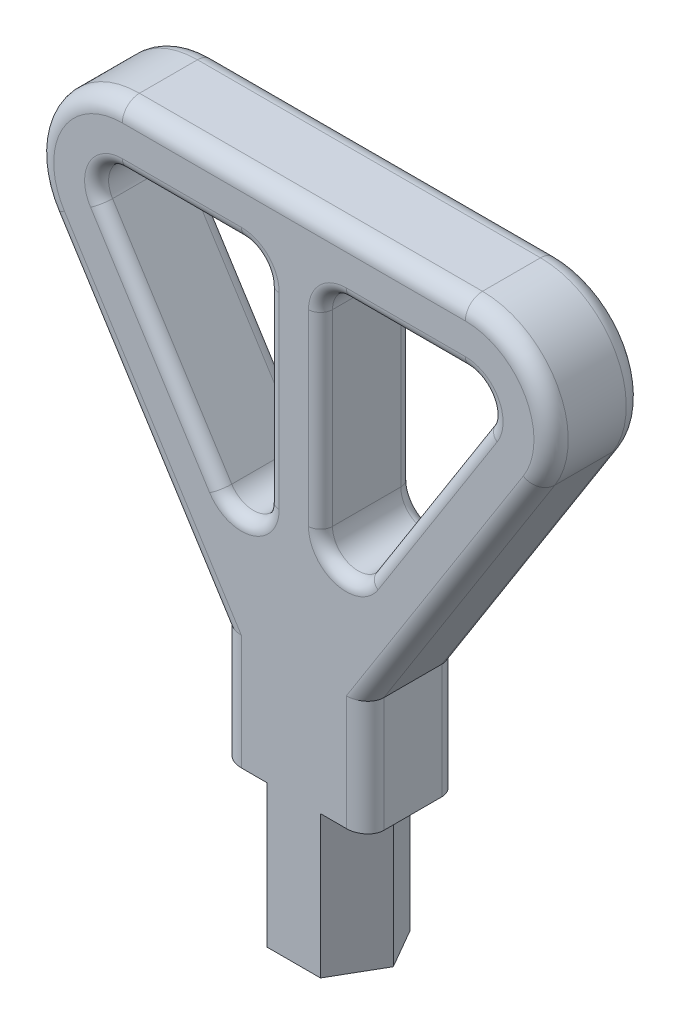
ISO-10303-21;
HEADER;
FILE_DESCRIPTION(('STEP AP214'),'2;1');
FILE_NAME('part.step','',(''),(''),'','','');
FILE_SCHEMA(('AUTOMOTIVE_DESIGN { 1 0 10303 214 1 1 1 1 }'));
ENDSEC;
DATA;
#1=APPLICATION_CONTEXT('core data for automotive mechanical design processes');
#2=APPLICATION_PROTOCOL_DEFINITION('international standard','automotive_design',2000,#1);
#3=PRODUCT_CONTEXT('',#1,'mechanical');
#4=PRODUCT('Part','Part','',(#3));
#5=PRODUCT_RELATED_PRODUCT_CATEGORY('part','',(#4));
#6=PRODUCT_DEFINITION_FORMATION('','',#4);
#7=PRODUCT_DEFINITION_CONTEXT('part definition',#1,'design');
#8=PRODUCT_DEFINITION('design','',#6,#7);
#9=PRODUCT_DEFINITION_SHAPE('','',#8);
#10=(LENGTH_UNIT() NAMED_UNIT(*) SI_UNIT(.MILLI.,.METRE.));
#11=(NAMED_UNIT(*) PLANE_ANGLE_UNIT() SI_UNIT($,.RADIAN.));
#12=(NAMED_UNIT(*) SI_UNIT($,.STERADIAN.) SOLID_ANGLE_UNIT());
#13=UNCERTAINTY_MEASURE_WITH_UNIT(LENGTH_MEASURE(1.E-05),#10,'distance_accuracy_value','');
#14=(GEOMETRIC_REPRESENTATION_CONTEXT(3) GLOBAL_UNCERTAINTY_ASSIGNED_CONTEXT((#13)) GLOBAL_UNIT_ASSIGNED_CONTEXT((#10,
#11,#12)) REPRESENTATION_CONTEXT('',''));
#15=CARTESIAN_POINT('',(0.,0.,0.));
#16=DIRECTION('',(0.,0.,1.));
#17=DIRECTION('',(1.,0.,0.));
#18=AXIS2_PLACEMENT_3D('',#15,#16,#17);
#19=CARTESIAN_POINT('',(-3.94618908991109,10.541,0.));
#20=DIRECTION('',(0.866025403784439,0.,-0.5));
#21=DIRECTION('',(-0.5,0.,-0.866025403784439));
#22=AXIS2_PLACEMENT_3D('',#19,#20,#21);
#23=PLANE('',#22);
#24=DIRECTION('',(0.,-1.,0.));
#25=VECTOR('',#24,1.);
#26=CARTESIAN_POINT('',(-1.97309454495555,10.541,3.4175));
#27=LINE('',#26,#25);
#28=CARTESIAN_POINT('',(-1.97309454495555,-12.827,3.4175));
#29=VERTEX_POINT('',#28);
#30=CARTESIAN_POINT('',(-1.97309454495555,-23.368,3.4175));
#31=VERTEX_POINT('',#30);
#32=EDGE_CURVE('E560',#29,#31,#27,.T.);
#33=ORIENTED_EDGE('',*,*,#32,.F.);
#34=DIRECTION('',(0.5,0.,0.866025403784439));
#35=VECTOR('',#34,1.);
#36=CARTESIAN_POINT('',(-3.94618908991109,-12.827,0.));
#37=LINE('',#36,#35);
#38=CARTESIAN_POINT('',(-3.94618908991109,-12.827,0.));
#39=VERTEX_POINT('',#38);
#40=EDGE_CURVE('E420',#39,#29,#37,.T.);
#41=ORIENTED_EDGE('',*,*,#40,.F.);
#42=DIRECTION('',(0.,-1.,0.));
#43=VECTOR('',#42,1.);
#44=CARTESIAN_POINT('',(-3.94618908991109,10.541,0.));
#45=LINE('',#44,#43);
#46=CARTESIAN_POINT('',(-3.94618908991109,-23.368,0.));
#47=VERTEX_POINT('',#46);
#48=EDGE_CURVE('E551',#39,#47,#45,.T.);
#49=ORIENTED_EDGE('',*,*,#48,.T.);
#50=DIRECTION('',(-0.5,0.,-0.866025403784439));
#51=VECTOR('',#50,1.);
#52=CARTESIAN_POINT('',(-1.97309454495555,-23.368,3.4175));
#53=LINE('',#52,#51);
#54=EDGE_CURVE('E471',#31,#47,#53,.T.);
#55=ORIENTED_EDGE('',*,*,#54,.F.);
#56=EDGE_LOOP('',(#33,#41,#49,#55));
#57=FACE_BOUND('',#56,.T.);
#58=ADVANCED_FACE('F41',(#57),#23,.F.);
#59=CARTESIAN_POINT('',(-1.97309454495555,10.541,3.4175));
#60=DIRECTION('',(0.,0.,-1.));
#61=DIRECTION('',(-1.,0.,0.));
#62=AXIS2_PLACEMENT_3D('',#59,#60,#61);
#63=PLANE('',#62);
#64=DIRECTION('',(0.,-1.,0.));
#65=VECTOR('',#64,1.);
#66=CARTESIAN_POINT('',(1.97309454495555,10.541,3.4175));
#67=LINE('',#66,#65);
#68=CARTESIAN_POINT('',(1.97309454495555,-12.827,3.4175));
#69=VERTEX_POINT('',#68);
#70=CARTESIAN_POINT('',(1.97309454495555,-23.368,3.4175));
#71=VERTEX_POINT('',#70);
#72=EDGE_CURVE('E557',#69,#71,#67,.T.);
#73=ORIENTED_EDGE('',*,*,#72,.F.);
#74=DIRECTION('',(-1.,0.,0.));
#75=VECTOR('',#74,1.);
#76=CARTESIAN_POINT('',(3.8864261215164,-12.827,3.4175));
#77=LINE('',#76,#75);
#78=CARTESIAN_POINT('',(3.8864261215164,-12.827,3.4175));
#79=VERTEX_POINT('',#78);
#80=EDGE_CURVE('E1224',#79,#69,#77,.T.);
#81=ORIENTED_EDGE('',*,*,#80,.F.);
#82=DIRECTION('',(0.,1.,0.));
#83=VECTOR('',#82,1.);
#84=CARTESIAN_POINT('',(3.8864261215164,-12.827,3.4175));
#85=LINE('',#84,#83);
#86=CARTESIAN_POINT('',(3.8864261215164,-4.318,3.4175));
#87=VERTEX_POINT('',#86);
#88=EDGE_CURVE('E1229',#79,#87,#85,.T.);
#89=ORIENTED_EDGE('',*,*,#88,.T.);
#90=DIRECTION('',(0.535838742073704,0.844320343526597,0.));
#91=VECTOR('',#90,1.);
#92=CARTESIAN_POINT('',(16.9891473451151,16.3279391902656,3.4175));
#93=LINE('',#92,#91);
#94=CARTESIAN_POINT('',(16.9891473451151,16.3279391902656,3.4175));
#95=VERTEX_POINT('',#94);
#96=EDGE_CURVE('E623',#87,#95,#93,.T.);
#97=ORIENTED_EDGE('',*,*,#96,.T.);
#98=CARTESIAN_POINT('',(12.7,19.05,3.4175));
#99=DIRECTION('',(0.,0.,-1.));
#100=DIRECTION('',(-1.,0.,0.));
#101=AXIS2_PLACEMENT_3D('',#98,#99,#100);
#102=CIRCLE('',#101,5.08);
#103=CARTESIAN_POINT('',(12.7,24.13,3.4175));
#104=VERTEX_POINT('',#103);
#105=EDGE_CURVE('E626',#95,#104,#102,.F.);
#106=ORIENTED_EDGE('',*,*,#105,.T.);
#107=DIRECTION('',(1.,0.,0.));
#108=VECTOR('',#107,1.);
#109=CARTESIAN_POINT('',(-12.7,24.13,3.4175));
#110=LINE('',#109,#108);
#111=CARTESIAN_POINT('',(-12.7,24.13,3.4175));
#112=VERTEX_POINT('',#111);
#113=EDGE_CURVE('E629',#104,#112,#110,.F.);
#114=ORIENTED_EDGE('',*,*,#113,.T.);
#115=CARTESIAN_POINT('',(-12.7,19.05,3.4175));
#116=DIRECTION('',(0.,0.,-1.));
#117=DIRECTION('',(-1.,0.,0.));
#118=AXIS2_PLACEMENT_3D('',#115,#116,#117);
#119=CIRCLE('',#118,5.08);
#120=CARTESIAN_POINT('',(-16.9891473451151,16.3279391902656,3.4175));
#121=VERTEX_POINT('',#120);
#122=EDGE_CURVE('E632',#112,#121,#119,.F.);
#123=ORIENTED_EDGE('',*,*,#122,.T.);
#124=DIRECTION('',(0.535838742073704,-0.844320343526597,0.));
#125=VECTOR('',#124,1.);
#126=CARTESIAN_POINT('',(-4.31830770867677,-3.6374847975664,3.4175));
#127=LINE('',#126,#125);
#128=CARTESIAN_POINT('',(-3.8864261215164,-4.318,3.4175));
#129=VERTEX_POINT('',#128);
#130=EDGE_CURVE('E635',#121,#129,#127,.T.);
#131=ORIENTED_EDGE('',*,*,#130,.T.);
#132=DIRECTION('',(0.,1.,0.));
#133=VECTOR('',#132,1.);
#134=CARTESIAN_POINT('',(-3.8864261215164,-12.827,3.4175));
#135=LINE('',#134,#133);
#136=CARTESIAN_POINT('',(-3.8864261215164,-12.827,3.4175));
#137=VERTEX_POINT('',#136);
#138=EDGE_CURVE('E427',#137,#129,#135,.T.);
#139=ORIENTED_EDGE('',*,*,#138,.F.);
#140=DIRECTION('',(-1.,0.,0.));
#141=VECTOR('',#140,1.);
#142=CARTESIAN_POINT('',(-1.97309454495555,-12.827,3.4175));
#143=LINE('',#142,#141);
#144=EDGE_CURVE('E424',#29,#137,#143,.T.);
#145=ORIENTED_EDGE('',*,*,#144,.F.);
#146=ORIENTED_EDGE('',*,*,#32,.T.);
#147=DIRECTION('',(-1.,0.,0.));
#148=VECTOR('',#147,1.);
#149=CARTESIAN_POINT('',(1.97309454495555,-23.368,3.4175));
#150=LINE('',#149,#148);
#151=EDGE_CURVE('E467',#71,#31,#150,.T.);
#152=ORIENTED_EDGE('',*,*,#151,.F.);
#153=EDGE_LOOP('',(#73,#81,#89,#97,#106,#114,#123,#131,#139,#145,#146,#152));
#154=FACE_BOUND('',#153,.T.);
#155=DIRECTION('',(0.,-1.,0.));
#156=VECTOR('',#155,1.);
#157=CARTESIAN_POINT('',(1.08409454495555,10.541,3.4175));
#158=LINE('',#157,#156);
#159=CARTESIAN_POINT('',(1.08409454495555,5.14933612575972,3.4175));
#160=VERTEX_POINT('',#159);
#161=CARTESIAN_POINT('',(1.08409454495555,19.05,3.4175));
#162=VERTEX_POINT('',#161);
#163=EDGE_CURVE('E802',#160,#162,#158,.F.);
#164=ORIENTED_EDGE('',*,*,#163,.T.);
#165=CARTESIAN_POINT('',(3.87809454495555,19.05,3.4175));
#166=DIRECTION('',(0.,0.,-1.));
#167=DIRECTION('',(-1.,0.,0.));
#168=AXIS2_PLACEMENT_3D('',#165,#166,#167);
#169=CIRCLE('',#168,2.794);
#170=CARTESIAN_POINT('',(3.87809454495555,21.844,3.4175));
#171=VERTEX_POINT('',#170);
#172=EDGE_CURVE('E817',#162,#171,#169,.T.);
#173=ORIENTED_EDGE('',*,*,#172,.T.);
#174=DIRECTION('',(-1.,0.,0.));
#175=VECTOR('',#174,1.);
#176=CARTESIAN_POINT('',(-1.97309454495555,21.844,3.4175));
#177=LINE('',#176,#175);
#178=CARTESIAN_POINT('',(12.7,21.844,3.4175));
#179=VERTEX_POINT('',#178);
#180=EDGE_CURVE('E814',#171,#179,#177,.F.);
#181=ORIENTED_EDGE('',*,*,#180,.T.);
#182=CARTESIAN_POINT('',(12.7,19.05,3.4175));
#183=DIRECTION('',(0.,0.,-1.));
#184=DIRECTION('',(-1.,0.,0.));
#185=AXIS2_PLACEMENT_3D('',#182,#183,#184);
#186=CIRCLE('',#185,2.794);
#187=CARTESIAN_POINT('',(15.0590310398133,17.5528665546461,3.4175));
#188=VERTEX_POINT('',#187);
#189=EDGE_CURVE('E811',#179,#188,#186,.T.);
#190=ORIENTED_EDGE('',*,*,#189,.T.);
#191=DIRECTION('',(0.535838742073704,0.844320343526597,0.));
#192=VECTOR('',#191,1.);
#193=CARTESIAN_POINT('',(6.9964078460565,4.84860265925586,3.4175));
#194=LINE('',#193,#192);
#195=CARTESIAN_POINT('',(6.23712558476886,3.65220268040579,3.4175));
#196=VERTEX_POINT('',#195);
#197=EDGE_CURVE('E808',#188,#196,#194,.F.);
#198=ORIENTED_EDGE('',*,*,#197,.T.);
#199=CARTESIAN_POINT('',(3.87809454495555,5.14933612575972,3.4175));
#200=DIRECTION('',(0.,0.,-1.));
#201=DIRECTION('',(-1.,0.,0.));
#202=AXIS2_PLACEMENT_3D('',#199,#200,#201);
#203=CIRCLE('',#202,2.794);
#204=EDGE_CURVE('E805',#196,#160,#203,.T.);
#205=ORIENTED_EDGE('',*,*,#204,.T.);
#206=EDGE_LOOP('',(#164,#173,#181,#190,#198,#205));
#207=FACE_BOUND('',#206,.T.);
#208=DIRECTION('',(0.535838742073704,-0.844320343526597,0.));
#209=VECTOR('',#208,1.);
#210=CARTESIAN_POINT('',(-8.12945011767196,6.63393575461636,3.4175));
#211=LINE('',#210,#209);
#212=CARTESIAN_POINT('',(-6.23712558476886,3.65220268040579,3.4175));
#213=VERTEX_POINT('',#212);
#214=CARTESIAN_POINT('',(-15.0590310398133,17.5528665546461,3.4175));
#215=VERTEX_POINT('',#214);
#216=EDGE_CURVE('E783',#213,#215,#211,.F.);
#217=ORIENTED_EDGE('',*,*,#216,.T.);
#218=CARTESIAN_POINT('',(-12.7,19.05,3.4175));
#219=DIRECTION('',(0.,0.,-1.));
#220=DIRECTION('',(-1.,0.,0.));
#221=AXIS2_PLACEMENT_3D('',#218,#219,#220);
#222=CIRCLE('',#221,2.794);
#223=CARTESIAN_POINT('',(-12.7,21.844,3.4175));
#224=VERTEX_POINT('',#223);
#225=EDGE_CURVE('E798',#215,#224,#222,.T.);
#226=ORIENTED_EDGE('',*,*,#225,.T.);
#227=DIRECTION('',(-1.,0.,0.));
#228=VECTOR('',#227,1.);
#229=CARTESIAN_POINT('',(-1.97309454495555,21.844,3.4175));
#230=LINE('',#229,#228);
#231=CARTESIAN_POINT('',(-3.87809454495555,21.844,3.4175));
#232=VERTEX_POINT('',#231);
#233=EDGE_CURVE('E795',#224,#232,#230,.F.);
#234=ORIENTED_EDGE('',*,*,#233,.T.);
#235=CARTESIAN_POINT('',(-3.87809454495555,19.05,3.4175));
#236=DIRECTION('',(0.,0.,-1.));
#237=DIRECTION('',(-1.,0.,0.));
#238=AXIS2_PLACEMENT_3D('',#235,#236,#237);
#239=CIRCLE('',#238,2.794);
#240=CARTESIAN_POINT('',(-1.08409454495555,19.05,3.4175));
#241=VERTEX_POINT('',#240);
#242=EDGE_CURVE('E792',#232,#241,#239,.T.);
#243=ORIENTED_EDGE('',*,*,#242,.T.);
#244=DIRECTION('',(0.,1.,0.));
#245=VECTOR('',#244,1.);
#246=CARTESIAN_POINT('',(-1.08409454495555,10.541,3.4175));
#247=LINE('',#246,#245);
#248=CARTESIAN_POINT('',(-1.08409454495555,5.14933612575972,3.4175));
#249=VERTEX_POINT('',#248);
#250=EDGE_CURVE('E789',#241,#249,#247,.F.);
#251=ORIENTED_EDGE('',*,*,#250,.T.);
#252=CARTESIAN_POINT('',(-3.87809454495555,5.14933612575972,3.4175));
#253=DIRECTION('',(0.,0.,-1.));
#254=DIRECTION('',(-1.,0.,0.));
#255=AXIS2_PLACEMENT_3D('',#252,#253,#254);
#256=CIRCLE('',#255,2.794);
#257=EDGE_CURVE('E786',#249,#213,#256,.T.);
#258=ORIENTED_EDGE('',*,*,#257,.T.);
#259=EDGE_LOOP('',(#217,#226,#234,#243,#251,#258));
#260=FACE_BOUND('',#259,.T.);
#261=ADVANCED_FACE('F925',(#154,#207,#260),#63,.F.);
#262=CARTESIAN_POINT('',(1.97309454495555,10.541,3.4175));
#263=DIRECTION('',(-0.866025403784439,0.,-0.5));
#264=DIRECTION('',(-0.5,0.,0.866025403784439));
#265=AXIS2_PLACEMENT_3D('',#262,#263,#264);
#266=PLANE('',#265);
#267=DIRECTION('',(0.,-1.,0.));
#268=VECTOR('',#267,1.);
#269=CARTESIAN_POINT('',(3.94618908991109,10.541,0.));
#270=LINE('',#269,#268);
#271=CARTESIAN_POINT('',(3.94618908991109,-12.827,0.));
#272=VERTEX_POINT('',#271);
#273=CARTESIAN_POINT('',(3.94618908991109,-23.368,0.));
#274=VERTEX_POINT('',#273);
#275=EDGE_CURVE('E554',#272,#274,#270,.T.);
#276=ORIENTED_EDGE('',*,*,#275,.F.);
#277=DIRECTION('',(0.499999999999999,0.,-0.866025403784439));
#278=VECTOR('',#277,1.);
#279=CARTESIAN_POINT('',(1.97309454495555,-12.827,3.4175));
#280=LINE('',#279,#278);
#281=EDGE_CURVE('E59',#69,#272,#280,.T.);
#282=ORIENTED_EDGE('',*,*,#281,.F.);
#283=ORIENTED_EDGE('',*,*,#72,.T.);
#284=DIRECTION('',(-0.5,0.,0.866025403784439));
#285=VECTOR('',#284,1.);
#286=CARTESIAN_POINT('',(3.94618908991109,-23.368,0.));
#287=LINE('',#286,#285);
#288=EDGE_CURVE('E463',#274,#71,#287,.T.);
#289=ORIENTED_EDGE('',*,*,#288,.F.);
#290=EDGE_LOOP('',(#276,#282,#283,#289));
#291=FACE_BOUND('',#290,.T.);
#292=ADVANCED_FACE('F1005',(#291),#266,.F.);
#293=CARTESIAN_POINT('',(3.94618908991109,10.541,0.));
#294=DIRECTION('',(-0.866025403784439,0.,0.5));
#295=DIRECTION('',(0.5,0.,0.866025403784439));
#296=AXIS2_PLACEMENT_3D('',#293,#294,#295);
#297=PLANE('',#296);
#298=DIRECTION('',(0.,1.,0.));
#299=VECTOR('',#298,1.);
#300=CARTESIAN_POINT('',(2.24453403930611,10.541,-2.94735300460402));
#301=LINE('',#300,#299);
#302=CARTESIAN_POINT('',(2.24453403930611,-23.368,-2.94735300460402));
#303=VERTEX_POINT('',#302);
#304=CARTESIAN_POINT('',(2.24453403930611,-12.827,-2.94735300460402));
#305=VERTEX_POINT('',#304);
#306=EDGE_CURVE('E570',#303,#305,#301,.T.);
#307=ORIENTED_EDGE('',*,*,#306,.T.);
#308=DIRECTION('',(-0.5,0.,-0.866025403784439));
#309=VECTOR('',#308,1.);
#310=CARTESIAN_POINT('',(3.94618908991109,-12.827,0.));
#311=LINE('',#310,#309);
#312=EDGE_CURVE('E67',#272,#305,#311,.T.);
#313=ORIENTED_EDGE('',*,*,#312,.F.);
#314=ORIENTED_EDGE('',*,*,#275,.T.);
#315=DIRECTION('',(0.5,0.,0.866025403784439));
#316=VECTOR('',#315,1.);
#317=CARTESIAN_POINT('',(2.24453403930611,-23.368,-2.94735300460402));
#318=LINE('',#317,#316);
#319=EDGE_CURVE('E459',#303,#274,#318,.T.);
#320=ORIENTED_EDGE('',*,*,#319,.F.);
#321=EDGE_LOOP('',(#307,#313,#314,#320));
#322=FACE_BOUND('',#321,.T.);
#323=ADVANCED_FACE('F1215',(#322),#297,.F.);
#324=CARTESIAN_POINT('',(1.97309454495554,10.541,-3.4175));
#325=DIRECTION('',(0.,0.,1.));
#326=DIRECTION('',(1.,0.,0.));
#327=AXIS2_PLACEMENT_3D('',#324,#325,#326);
#328=PLANE('',#327);
#329=DIRECTION('',(1.,0.,0.));
#330=VECTOR('',#329,1.);
#331=CARTESIAN_POINT('',(1.57309454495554,-12.827,-3.4175));
#332=LINE('',#331,#330);
#333=CARTESIAN_POINT('',(1.57309454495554,-12.827,-3.4175));
#334=VERTEX_POINT('',#333);
#335=CARTESIAN_POINT('',(3.8864261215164,-12.827,-3.4175));
#336=VERTEX_POINT('',#335);
#337=EDGE_CURVE('E349',#334,#336,#332,.T.);
#338=ORIENTED_EDGE('',*,*,#337,.F.);
#339=DIRECTION('',(0.,-1.,0.));
#340=VECTOR('',#339,1.);
#341=CARTESIAN_POINT('',(1.57309454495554,10.541,-3.4175));
#342=LINE('',#341,#340);
#343=CARTESIAN_POINT('',(1.57309454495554,-23.368,-3.4175));
#344=VERTEX_POINT('',#343);
#345=EDGE_CURVE('E567',#334,#344,#342,.T.);
#346=ORIENTED_EDGE('',*,*,#345,.T.);
#347=DIRECTION('',(1.,0.,0.));
#348=VECTOR('',#347,1.);
#349=CARTESIAN_POINT('',(-1.57309454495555,-23.368,-3.4175));
#350=LINE('',#349,#348);
#351=CARTESIAN_POINT('',(-1.57309454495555,-23.368,-3.4175));
#352=VERTEX_POINT('',#351);
#353=EDGE_CURVE('E451',#352,#344,#350,.T.);
#354=ORIENTED_EDGE('',*,*,#353,.F.);
#355=DIRECTION('',(0.,1.,0.));
#356=VECTOR('',#355,1.);
#357=CARTESIAN_POINT('',(-1.57309454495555,10.541,-3.4175));
#358=LINE('',#357,#356);
#359=CARTESIAN_POINT('',(-1.57309454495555,-12.827,-3.4175));
#360=VERTEX_POINT('',#359);
#361=EDGE_CURVE('E563',#352,#360,#358,.T.);
#362=ORIENTED_EDGE('',*,*,#361,.T.);
#363=DIRECTION('',(1.,0.,0.));
#364=VECTOR('',#363,1.);
#365=CARTESIAN_POINT('',(-3.8864261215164,-12.827,-3.4175));
#366=LINE('',#365,#364);
#367=CARTESIAN_POINT('',(-3.8864261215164,-12.827,-3.4175));
#368=VERTEX_POINT('',#367);
#369=EDGE_CURVE('E406',#368,#360,#366,.T.);
#370=ORIENTED_EDGE('',*,*,#369,.F.);
#371=DIRECTION('',(0.,1.,0.));
#372=VECTOR('',#371,1.);
#373=CARTESIAN_POINT('',(-3.8864261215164,-12.827,-3.4175));
#374=LINE('',#373,#372);
#375=CARTESIAN_POINT('',(-3.8864261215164,-4.318,-3.4175));
#376=VERTEX_POINT('',#375);
#377=EDGE_CURVE('E431',#368,#376,#374,.T.);
#378=ORIENTED_EDGE('',*,*,#377,.T.);
#379=DIRECTION('',(-0.535838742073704,0.844320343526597,0.));
#380=VECTOR('',#379,1.);
#381=CARTESIAN_POINT('',(-16.9891473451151,16.3279391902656,-3.4175));
#382=LINE('',#381,#380);
#383=CARTESIAN_POINT('',(-16.9891473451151,16.3279391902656,-3.4175));
#384=VERTEX_POINT('',#383);
#385=EDGE_CURVE('E587',#376,#384,#382,.T.);
#386=ORIENTED_EDGE('',*,*,#385,.T.);
#387=CARTESIAN_POINT('',(-12.7,19.05,-3.4175));
#388=DIRECTION('',(0.,0.,1.));
#389=DIRECTION('',(1.,0.,0.));
#390=AXIS2_PLACEMENT_3D('',#387,#388,#389);
#391=CIRCLE('',#390,5.08);
#392=CARTESIAN_POINT('',(-12.7,24.13,-3.4175));
#393=VERTEX_POINT('',#392);
#394=EDGE_CURVE('E584',#384,#393,#391,.F.);
#395=ORIENTED_EDGE('',*,*,#394,.T.);
#396=DIRECTION('',(-1.,0.,0.));
#397=VECTOR('',#396,1.);
#398=CARTESIAN_POINT('',(12.7,24.13,-3.4175));
#399=LINE('',#398,#397);
#400=CARTESIAN_POINT('',(12.7,24.13,-3.4175));
#401=VERTEX_POINT('',#400);
#402=EDGE_CURVE('E581',#393,#401,#399,.F.);
#403=ORIENTED_EDGE('',*,*,#402,.T.);
#404=CARTESIAN_POINT('',(12.7,19.05,-3.4175));
#405=DIRECTION('',(0.,0.,1.));
#406=DIRECTION('',(1.,0.,0.));
#407=AXIS2_PLACEMENT_3D('',#404,#405,#406);
#408=CIRCLE('',#407,5.08);
#409=CARTESIAN_POINT('',(16.9891473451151,16.3279391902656,-3.4175));
#410=VERTEX_POINT('',#409);
#411=EDGE_CURVE('E578',#401,#410,#408,.F.);
#412=ORIENTED_EDGE('',*,*,#411,.T.);
#413=DIRECTION('',(-0.535838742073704,-0.844320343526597,0.));
#414=VECTOR('',#413,1.);
#415=CARTESIAN_POINT('',(4.31830770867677,-3.63748479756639,-3.4175));
#416=LINE('',#415,#414);
#417=CARTESIAN_POINT('',(3.8864261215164,-4.318,-3.4175));
#418=VERTEX_POINT('',#417);
#419=EDGE_CURVE('E364',#410,#418,#416,.T.);
#420=ORIENTED_EDGE('',*,*,#419,.T.);
#421=DIRECTION('',(0.,1.,0.));
#422=VECTOR('',#421,1.);
#423=CARTESIAN_POINT('',(3.8864261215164,-12.827,-3.4175));
#424=LINE('',#423,#422);
#425=EDGE_CURVE('E360',#336,#418,#424,.T.);
#426=ORIENTED_EDGE('',*,*,#425,.F.);
#427=EDGE_LOOP('',(#338,#346,#354,#362,#370,#378,#386,#395,#403,#412,#420,#426));
#428=FACE_BOUND('',#427,.T.);
#429=DIRECTION('',(0.,-1.,0.));
#430=VECTOR('',#429,1.);
#431=CARTESIAN_POINT('',(1.08409454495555,10.541,-3.4175));
#432=LINE('',#431,#430);
#433=CARTESIAN_POINT('',(1.08409454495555,19.05,-3.4175));
#434=VERTEX_POINT('',#433);
#435=CARTESIAN_POINT('',(1.08409454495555,5.14933612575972,-3.4175));
#436=VERTEX_POINT('',#435);
#437=EDGE_CURVE('E712',#434,#436,#432,.T.);
#438=ORIENTED_EDGE('',*,*,#437,.T.);
#439=CARTESIAN_POINT('',(3.87809454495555,5.14933612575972,-3.4175));
#440=DIRECTION('',(0.,0.,1.));
#441=DIRECTION('',(1.,0.,0.));
#442=AXIS2_PLACEMENT_3D('',#439,#440,#441);
#443=CIRCLE('',#442,2.794);
#444=CARTESIAN_POINT('',(6.23712558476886,3.65220268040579,-3.4175));
#445=VERTEX_POINT('',#444);
#446=EDGE_CURVE('E715',#436,#445,#443,.T.);
#447=ORIENTED_EDGE('',*,*,#446,.T.);
#448=DIRECTION('',(0.535838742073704,0.844320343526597,0.));
#449=VECTOR('',#448,1.);
#450=CARTESIAN_POINT('',(8.12945011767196,6.63393575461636,-3.4175));
#451=LINE('',#450,#449);
#452=CARTESIAN_POINT('',(15.0590310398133,17.5528665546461,-3.4175));
#453=VERTEX_POINT('',#452);
#454=EDGE_CURVE('E700',#445,#453,#451,.T.);
#455=ORIENTED_EDGE('',*,*,#454,.T.);
#456=CARTESIAN_POINT('',(12.7,19.05,-3.4175));
#457=DIRECTION('',(0.,0.,1.));
#458=DIRECTION('',(1.,0.,0.));
#459=AXIS2_PLACEMENT_3D('',#456,#457,#458);
#460=CIRCLE('',#459,2.794);
#461=CARTESIAN_POINT('',(12.7,21.844,-3.4175));
#462=VERTEX_POINT('',#461);
#463=EDGE_CURVE('E703',#453,#462,#460,.T.);
#464=ORIENTED_EDGE('',*,*,#463,.T.);
#465=DIRECTION('',(-1.,0.,0.));
#466=VECTOR('',#465,1.);
#467=CARTESIAN_POINT('',(1.97309454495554,21.844,-3.4175));
#468=LINE('',#467,#466);
#469=CARTESIAN_POINT('',(3.87809454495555,21.844,-3.4175));
#470=VERTEX_POINT('',#469);
#471=EDGE_CURVE('E706',#462,#470,#468,.T.);
#472=ORIENTED_EDGE('',*,*,#471,.T.);
#473=CARTESIAN_POINT('',(3.87809454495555,19.05,-3.4175));
#474=DIRECTION('',(0.,0.,1.));
#475=DIRECTION('',(1.,0.,0.));
#476=AXIS2_PLACEMENT_3D('',#473,#474,#475);
#477=CIRCLE('',#476,2.794);
#478=EDGE_CURVE('E709',#470,#434,#477,.T.);
#479=ORIENTED_EDGE('',*,*,#478,.T.);
#480=EDGE_LOOP('',(#438,#447,#455,#464,#472,#479));
#481=FACE_BOUND('',#480,.T.);
#482=DIRECTION('',(-1.,0.,0.));
#483=VECTOR('',#482,1.);
#484=CARTESIAN_POINT('',(1.97309454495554,21.844,-3.4175));
#485=LINE('',#484,#483);
#486=CARTESIAN_POINT('',(-3.87809454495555,21.844,-3.4175));
#487=VERTEX_POINT('',#486);
#488=CARTESIAN_POINT('',(-12.7,21.844,-3.4175));
#489=VERTEX_POINT('',#488);
#490=EDGE_CURVE('E693',#487,#489,#485,.T.);
#491=ORIENTED_EDGE('',*,*,#490,.T.);
#492=CARTESIAN_POINT('',(-12.7,19.05,-3.4175));
#493=DIRECTION('',(0.,0.,1.));
#494=DIRECTION('',(1.,0.,0.));
#495=AXIS2_PLACEMENT_3D('',#492,#493,#494);
#496=CIRCLE('',#495,2.794);
#497=CARTESIAN_POINT('',(-15.0590310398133,17.5528665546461,-3.4175));
#498=VERTEX_POINT('',#497);
#499=EDGE_CURVE('E696',#489,#498,#496,.T.);
#500=ORIENTED_EDGE('',*,*,#499,.T.);
#501=DIRECTION('',(0.535838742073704,-0.844320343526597,0.));
#502=VECTOR('',#501,1.);
#503=CARTESIAN_POINT('',(-6.9964078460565,4.84860265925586,-3.4175));
#504=LINE('',#503,#502);
#505=CARTESIAN_POINT('',(-6.23712558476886,3.65220268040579,-3.4175));
#506=VERTEX_POINT('',#505);
#507=EDGE_CURVE('E652',#498,#506,#504,.T.);
#508=ORIENTED_EDGE('',*,*,#507,.T.);
#509=CARTESIAN_POINT('',(-3.87809454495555,5.14933612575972,-3.4175));
#510=DIRECTION('',(0.,0.,1.));
#511=DIRECTION('',(1.,0.,0.));
#512=AXIS2_PLACEMENT_3D('',#509,#510,#511);
#513=CIRCLE('',#512,2.794);
#514=CARTESIAN_POINT('',(-1.08409454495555,5.14933612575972,-3.4175));
#515=VERTEX_POINT('',#514);
#516=EDGE_CURVE('E684',#506,#515,#513,.T.);
#517=ORIENTED_EDGE('',*,*,#516,.T.);
#518=DIRECTION('',(0.,1.,0.));
#519=VECTOR('',#518,1.);
#520=CARTESIAN_POINT('',(-1.08409454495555,10.541,-3.4175));
#521=LINE('',#520,#519);
#522=CARTESIAN_POINT('',(-1.08409454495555,19.05,-3.4175));
#523=VERTEX_POINT('',#522);
#524=EDGE_CURVE('E687',#515,#523,#521,.T.);
#525=ORIENTED_EDGE('',*,*,#524,.T.);
#526=CARTESIAN_POINT('',(-3.87809454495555,19.05,-3.4175));
#527=DIRECTION('',(0.,0.,1.));
#528=DIRECTION('',(1.,0.,0.));
#529=AXIS2_PLACEMENT_3D('',#526,#527,#528);
#530=CIRCLE('',#529,2.794);
#531=EDGE_CURVE('E690',#523,#487,#530,.T.);
#532=ORIENTED_EDGE('',*,*,#531,.T.);
#533=EDGE_LOOP('',(#491,#500,#508,#517,#525,#532));
#534=FACE_BOUND('',#533,.T.);
#535=ADVANCED_FACE('F361',(#428,#481,#534),#328,.F.);
#536=CARTESIAN_POINT('',(-1.97309454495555,10.541,-3.4175));
#537=DIRECTION('',(0.866025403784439,0.,0.5));
#538=DIRECTION('',(0.5,0.,-0.866025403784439));
#539=AXIS2_PLACEMENT_3D('',#536,#537,#538);
#540=PLANE('',#539);
#541=ORIENTED_EDGE('',*,*,#48,.F.);
#542=DIRECTION('',(-0.5,0.,0.866025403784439));
#543=VECTOR('',#542,1.);
#544=CARTESIAN_POINT('',(-2.24453403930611,-12.827,-2.94735300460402));
#545=LINE('',#544,#543);
#546=CARTESIAN_POINT('',(-2.24453403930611,-12.827,-2.94735300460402));
#547=VERTEX_POINT('',#546);
#548=EDGE_CURVE('E416',#547,#39,#545,.T.);
#549=ORIENTED_EDGE('',*,*,#548,.F.);
#550=DIRECTION('',(0.,-1.,0.));
#551=VECTOR('',#550,1.);
#552=CARTESIAN_POINT('',(-2.24453403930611,10.541,-2.94735300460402));
#553=LINE('',#552,#551);
#554=CARTESIAN_POINT('',(-2.24453403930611,-23.368,-2.94735300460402));
#555=VERTEX_POINT('',#554);
#556=EDGE_CURVE('E573',#547,#555,#553,.T.);
#557=ORIENTED_EDGE('',*,*,#556,.T.);
#558=DIRECTION('',(0.5,0.,-0.866025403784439));
#559=VECTOR('',#558,1.);
#560=CARTESIAN_POINT('',(-3.94618908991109,-23.368,0.));
#561=LINE('',#560,#559);
#562=EDGE_CURVE('E443',#47,#555,#561,.T.);
#563=ORIENTED_EDGE('',*,*,#562,.F.);
#564=EDGE_LOOP('',(#541,#549,#557,#563));
#565=FACE_BOUND('',#564,.T.);
#566=ADVANCED_FACE('F1208',(#565),#540,.F.);
#567=CARTESIAN_POINT('',(1.97309454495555,25.4,0.));
#568=DIRECTION('',(0.,1.,0.));
#569=DIRECTION('',(0.,0.,1.));
#570=AXIS2_PLACEMENT_3D('',#567,#568,#569);
#571=PLANE('',#570);
#572=DIRECTION('',(0.,0.,-1.));
#573=VECTOR('',#572,1.);
#574=CARTESIAN_POINT('',(12.7,25.4,43.5784262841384));
#575=LINE('',#574,#573);
#576=CARTESIAN_POINT('',(12.7,25.4,2.1475));
#577=VERTEX_POINT('',#576);
#578=CARTESIAN_POINT('',(12.7,25.4,-2.1475));
#579=VERTEX_POINT('',#578);
#580=EDGE_CURVE('E547',#577,#579,#575,.T.);
#581=ORIENTED_EDGE('',*,*,#580,.T.);
#582=DIRECTION('',(-1.,0.,0.));
#583=VECTOR('',#582,1.);
#584=CARTESIAN_POINT('',(-12.7,25.4,-2.1475));
#585=LINE('',#584,#583);
#586=CARTESIAN_POINT('',(-12.7,25.4,-2.1475));
#587=VERTEX_POINT('',#586);
#588=EDGE_CURVE('E614',#579,#587,#585,.T.);
#589=ORIENTED_EDGE('',*,*,#588,.T.);
#590=DIRECTION('',(0.,0.,-1.));
#591=VECTOR('',#590,1.);
#592=CARTESIAN_POINT('',(-12.7,25.4,43.5784262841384));
#593=LINE('',#592,#591);
#594=CARTESIAN_POINT('',(-12.7,25.4,2.1475));
#595=VERTEX_POINT('',#594);
#596=EDGE_CURVE('E530',#595,#587,#593,.T.);
#597=ORIENTED_EDGE('',*,*,#596,.F.);
#598=DIRECTION('',(1.,0.,0.));
#599=VECTOR('',#598,1.);
#600=CARTESIAN_POINT('',(12.7,25.4,2.1475));
#601=LINE('',#600,#599);
#602=EDGE_CURVE('E611',#595,#577,#601,.T.);
#603=ORIENTED_EDGE('',*,*,#602,.T.);
#604=EDGE_LOOP('',(#581,#589,#597,#603));
#605=FACE_BOUND('',#604,.T.);
#606=ADVANCED_FACE('F1201',(#605),#571,.T.);
#607=CARTESIAN_POINT('',(-12.7,19.05,43.5784262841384));
#608=DIRECTION('',(0.,0.,-1.));
#609=DIRECTION('',(-1.,0.,0.));
#610=AXIS2_PLACEMENT_3D('',#607,#608,#609);
#611=CYLINDRICAL_SURFACE('',#610,6.35);
#612=ORIENTED_EDGE('',*,*,#596,.T.);
#613=CARTESIAN_POINT('',(-12.7,19.05,-2.1475));
#614=DIRECTION('',(0.,0.,1.));
#615=DIRECTION('',(1.,0.,0.));
#616=AXIS2_PLACEMENT_3D('',#613,#614,#615);
#617=CIRCLE('',#616,6.35);
#618=CARTESIAN_POINT('',(-18.0614341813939,15.647423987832,-2.1475));
#619=VERTEX_POINT('',#618);
#620=EDGE_CURVE('E608',#587,#619,#617,.T.);
#621=ORIENTED_EDGE('',*,*,#620,.T.);
#622=DIRECTION('',(0.,0.,1.));
#623=VECTOR('',#622,1.);
#624=CARTESIAN_POINT('',(-18.0614341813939,15.647423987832,-44.6907331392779));
#625=LINE('',#624,#623);
#626=CARTESIAN_POINT('',(-18.0614341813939,15.647423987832,2.1475));
#627=VERTEX_POINT('',#626);
#628=EDGE_CURVE('E526',#619,#627,#625,.T.);
#629=ORIENTED_EDGE('',*,*,#628,.T.);
#630=CARTESIAN_POINT('',(-12.7,19.05,2.1475));
#631=DIRECTION('',(0.,0.,-1.));
#632=DIRECTION('',(-1.,0.,0.));
#633=AXIS2_PLACEMENT_3D('',#630,#631,#632);
#634=CIRCLE('',#633,6.35);
#635=EDGE_CURVE('E605',#627,#595,#634,.T.);
#636=ORIENTED_EDGE('',*,*,#635,.T.);
#637=EDGE_LOOP('',(#612,#621,#629,#636));
#638=FACE_BOUND('',#637,.T.);
#639=ADVANCED_FACE('F1198',(#638),#611,.T.);
#640=CARTESIAN_POINT('',(12.7,19.05,43.5784262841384));
#641=DIRECTION('',(0.,0.,-1.));
#642=DIRECTION('',(-1.,0.,0.));
#643=AXIS2_PLACEMENT_3D('',#640,#641,#642);
#644=CYLINDRICAL_SURFACE('',#643,6.35);
#645=DIRECTION('',(0.,0.,1.));
#646=VECTOR('',#645,1.);
#647=CARTESIAN_POINT('',(18.0614341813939,15.647423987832,-44.6907331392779));
#648=LINE('',#647,#646);
#649=CARTESIAN_POINT('',(18.0614341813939,15.647423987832,-2.1475));
#650=VERTEX_POINT('',#649);
#651=CARTESIAN_POINT('',(18.0614341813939,15.647423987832,2.1475));
#652=VERTEX_POINT('',#651);
#653=EDGE_CURVE('E531',#650,#652,#648,.T.);
#654=ORIENTED_EDGE('',*,*,#653,.F.);
#655=CARTESIAN_POINT('',(12.7,19.05,-2.1475));
#656=DIRECTION('',(0.,0.,1.));
#657=DIRECTION('',(1.,0.,0.));
#658=AXIS2_PLACEMENT_3D('',#655,#656,#657);
#659=CIRCLE('',#658,6.35);
#660=EDGE_CURVE('E620',#650,#579,#659,.T.);
#661=ORIENTED_EDGE('',*,*,#660,.T.);
#662=ORIENTED_EDGE('',*,*,#580,.F.);
#663=CARTESIAN_POINT('',(12.7,19.05,2.1475));
#664=DIRECTION('',(0.,0.,-1.));
#665=DIRECTION('',(-1.,0.,0.));
#666=AXIS2_PLACEMENT_3D('',#663,#664,#665);
#667=CIRCLE('',#666,6.35);
#668=EDGE_CURVE('E617',#577,#652,#667,.T.);
#669=ORIENTED_EDGE('',*,*,#668,.T.);
#670=EDGE_LOOP('',(#654,#661,#662,#669));
#671=FACE_BOUND('',#670,.T.);
#672=ADVANCED_FACE('F1014',(#671),#644,.T.);
#673=CARTESIAN_POINT('',(1.57309454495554,10.541,-3.4175));
#674=DIRECTION('',(-0.573576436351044,0.,0.819152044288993));
#675=DIRECTION('',(0.,-1.,0.));
#676=AXIS2_PLACEMENT_3D('',#673,#674,#675);
#677=PLANE('',#676);
#678=DIRECTION('',(-0.819152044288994,0.,-0.573576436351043));
#679=VECTOR('',#678,1.);
#680=CARTESIAN_POINT('',(2.24453403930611,-12.827,-2.94735300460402));
#681=LINE('',#680,#679);
#682=EDGE_CURVE('E355',#305,#334,#681,.T.);
#683=ORIENTED_EDGE('',*,*,#682,.F.);
#684=ORIENTED_EDGE('',*,*,#306,.F.);
#685=DIRECTION('',(0.819152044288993,0.,0.573576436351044));
#686=VECTOR('',#685,1.);
#687=CARTESIAN_POINT('',(1.57309454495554,-23.368,-3.4175));
#688=LINE('',#687,#686);
#689=EDGE_CURVE('E455',#344,#303,#688,.T.);
#690=ORIENTED_EDGE('',*,*,#689,.F.);
#691=ORIENTED_EDGE('',*,*,#345,.F.);
#692=EDGE_LOOP('',(#683,#684,#690,#691));
#693=FACE_BOUND('',#692,.T.);
#694=ADVANCED_FACE('F1010',(#693),#677,.F.);
#695=CARTESIAN_POINT('',(-2.24453403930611,10.541,-2.94735300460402));
#696=DIRECTION('',(0.573576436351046,0.,0.819152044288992));
#697=DIRECTION('',(0.,-1.,0.));
#698=AXIS2_PLACEMENT_3D('',#695,#696,#697);
#699=PLANE('',#698);
#700=DIRECTION('',(-0.819152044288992,0.,0.573576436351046));
#701=VECTOR('',#700,1.);
#702=CARTESIAN_POINT('',(-1.57309454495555,-12.827,-3.4175));
#703=LINE('',#702,#701);
#704=EDGE_CURVE('E412',#360,#547,#703,.T.);
#705=ORIENTED_EDGE('',*,*,#704,.F.);
#706=ORIENTED_EDGE('',*,*,#361,.F.);
#707=DIRECTION('',(0.819152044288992,0.,-0.573576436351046));
#708=VECTOR('',#707,1.);
#709=CARTESIAN_POINT('',(-2.24453403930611,-23.368,-2.94735300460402));
#710=LINE('',#709,#708);
#711=EDGE_CURVE('E447',#555,#352,#710,.T.);
#712=ORIENTED_EDGE('',*,*,#711,.F.);
#713=ORIENTED_EDGE('',*,*,#556,.F.);
#714=EDGE_LOOP('',(#705,#706,#712,#713));
#715=FACE_BOUND('',#714,.T.);
#716=ADVANCED_FACE('F1013',(#715),#699,.F.);
#717=CARTESIAN_POINT('',(5.39059454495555,-4.318,-44.6907331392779));
#718=DIRECTION('',(0.844320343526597,-0.535838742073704,0.));
#719=DIRECTION('',(0.535838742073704,0.844320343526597,0.));
#720=AXIS2_PLACEMENT_3D('',#717,#718,#719);
#721=PLANE('',#720);
#722=DIRECTION('',(0.,0.,1.));
#723=VECTOR('',#722,1.);
#724=CARTESIAN_POINT('',(5.39059454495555,-4.318,-44.6907331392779));
#725=LINE('',#724,#723);
#726=CARTESIAN_POINT('',(5.39059454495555,-4.318,-2.1475));
#727=VERTEX_POINT('',#726);
#728=CARTESIAN_POINT('',(5.39059454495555,-4.318,2.1475));
#729=VERTEX_POINT('',#728);
#730=EDGE_CURVE('E535',#727,#729,#725,.T.);
#731=ORIENTED_EDGE('',*,*,#730,.F.);
#732=DIRECTION('',(-0.535838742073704,-0.844320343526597,0.));
#733=VECTOR('',#732,1.);
#734=CARTESIAN_POINT('',(18.0614341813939,15.647423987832,-2.1475));
#735=LINE('',#734,#733);
#736=EDGE_CURVE('E649',#727,#650,#735,.F.);
#737=ORIENTED_EDGE('',*,*,#736,.T.);
#738=ORIENTED_EDGE('',*,*,#653,.T.);
#739=DIRECTION('',(0.535838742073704,0.844320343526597,0.));
#740=VECTOR('',#739,1.);
#741=CARTESIAN_POINT('',(5.39059454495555,-4.318,2.1475));
#742=LINE('',#741,#740);
#743=EDGE_CURVE('E646',#652,#729,#742,.F.);
#744=ORIENTED_EDGE('',*,*,#743,.T.);
#745=EDGE_LOOP('',(#731,#737,#738,#744));
#746=FACE_BOUND('',#745,.T.);
#747=ADVANCED_FACE('F1018',(#746),#721,.T.);
#748=CARTESIAN_POINT('',(-5.39059454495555,-4.318,-44.6907331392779));
#749=DIRECTION('',(-0.844320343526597,-0.535838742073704,0.));
#750=DIRECTION('',(0.535838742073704,-0.844320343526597,0.));
#751=AXIS2_PLACEMENT_3D('',#748,#749,#750);
#752=PLANE('',#751);
#753=ORIENTED_EDGE('',*,*,#628,.F.);
#754=DIRECTION('',(-0.535838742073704,0.844320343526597,0.));
#755=VECTOR('',#754,1.);
#756=CARTESIAN_POINT('',(-5.39059454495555,-4.318,-2.1475));
#757=LINE('',#756,#755);
#758=CARTESIAN_POINT('',(-5.39059454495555,-4.318,-2.1475));
#759=VERTEX_POINT('',#758);
#760=EDGE_CURVE('E594',#619,#759,#757,.F.);
#761=ORIENTED_EDGE('',*,*,#760,.T.);
#762=DIRECTION('',(0.,0.,1.));
#763=VECTOR('',#762,1.);
#764=CARTESIAN_POINT('',(-5.39059454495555,-4.318,-44.6907331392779));
#765=LINE('',#764,#763);
#766=CARTESIAN_POINT('',(-5.39059454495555,-4.318,2.1475));
#767=VERTEX_POINT('',#766);
#768=EDGE_CURVE('E539',#759,#767,#765,.T.);
#769=ORIENTED_EDGE('',*,*,#768,.T.);
#770=DIRECTION('',(0.535838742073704,-0.844320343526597,0.));
#771=VECTOR('',#770,1.);
#772=CARTESIAN_POINT('',(-18.0614341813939,15.647423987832,2.1475));
#773=LINE('',#772,#771);
#774=EDGE_CURVE('E591',#767,#627,#773,.F.);
#775=ORIENTED_EDGE('',*,*,#774,.T.);
#776=EDGE_LOOP('',(#753,#761,#769,#775));
#777=FACE_BOUND('',#776,.T.);
#778=ADVANCED_FACE('F1040',(#777),#752,.T.);
#779=CARTESIAN_POINT('',(10.0595664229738,5.40900839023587,-2.1475));
#780=DIRECTION('',(0.535838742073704,0.844320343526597,0.));
#781=DIRECTION('',(-0.844320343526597,0.535838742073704,0.));
#782=AXIS2_PLACEMENT_3D('',#779,#780,#781);
#783=CYLINDRICAL_SURFACE('',#782,1.27);
#784=CARTESIAN_POINT('',(3.8864261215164,-4.318,-2.1475));
#785=DIRECTION('',(0.,-1.,0.));
#786=DIRECTION('',(1.,0.,0.));
#787=AXIS2_PLACEMENT_3D('',#784,#785,#786);
#788=ELLIPSE('',#787,1.50416842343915,1.27);
#789=EDGE_CURVE('E643',#418,#727,#788,.T.);
#790=ORIENTED_EDGE('',*,*,#789,.F.);
#791=ORIENTED_EDGE('',*,*,#419,.F.);
#792=CARTESIAN_POINT('',(16.9891473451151,16.3279391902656,-2.1475));
#793=DIRECTION('',(0.535838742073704,0.844320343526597,0.));
#794=DIRECTION('',(-0.844320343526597,0.535838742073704,0.));
#795=AXIS2_PLACEMENT_3D('',#792,#793,#794);
#796=CIRCLE('',#795,1.27);
#797=EDGE_CURVE('E543',#650,#410,#796,.T.);
#798=ORIENTED_EDGE('',*,*,#797,.F.);
#799=ORIENTED_EDGE('',*,*,#736,.F.);
#800=EDGE_LOOP('',(#790,#791,#798,#799));
#801=FACE_BOUND('',#800,.T.);
#802=ADVANCED_FACE('F1036',(#801),#783,.T.);
#803=CARTESIAN_POINT('',(12.7,19.05,-2.1475));
#804=DIRECTION('',(0.,0.,1.));
#805=DIRECTION('',(1.,0.,0.));
#806=AXIS2_PLACEMENT_3D('',#803,#804,#805);
#807=TOROIDAL_SURFACE('',#806,5.08,1.27);
#808=ORIENTED_EDGE('',*,*,#797,.T.);
#809=ORIENTED_EDGE('',*,*,#411,.F.);
#810=CARTESIAN_POINT('',(12.7,24.13,-2.1475));
#811=DIRECTION('',(-1.,0.,0.));
#812=DIRECTION('',(0.,0.,1.));
#813=AXIS2_PLACEMENT_3D('',#810,#811,#812);
#814=CIRCLE('',#813,1.27);
#815=EDGE_CURVE('E661',#579,#401,#814,.T.);
#816=ORIENTED_EDGE('',*,*,#815,.F.);
#817=ORIENTED_EDGE('',*,*,#660,.F.);
#818=EDGE_LOOP('',(#808,#809,#816,#817));
#819=FACE_BOUND('',#818,.T.);
#820=ADVANCED_FACE('F1032',(#819),#807,.T.);
#821=CARTESIAN_POINT('',(1.97309454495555,24.13,-2.1475));
#822=DIRECTION('',(1.,0.,0.));
#823=DIRECTION('',(0.,0.,-1.));
#824=AXIS2_PLACEMENT_3D('',#821,#822,#823);
#825=CYLINDRICAL_SURFACE('',#824,1.27);
#826=ORIENTED_EDGE('',*,*,#815,.T.);
#827=ORIENTED_EDGE('',*,*,#402,.F.);
#828=CARTESIAN_POINT('',(-12.7,24.13,-2.1475));
#829=DIRECTION('',(-1.,0.,0.));
#830=DIRECTION('',(0.,0.,1.));
#831=AXIS2_PLACEMENT_3D('',#828,#829,#830);
#832=CIRCLE('',#831,1.27);
#833=EDGE_CURVE('E656',#587,#393,#832,.T.);
#834=ORIENTED_EDGE('',*,*,#833,.F.);
#835=ORIENTED_EDGE('',*,*,#588,.F.);
#836=EDGE_LOOP('',(#826,#827,#834,#835));
#837=FACE_BOUND('',#836,.T.);
#838=ADVANCED_FACE('F1028',(#837),#825,.T.);
#839=CARTESIAN_POINT('',(-12.7,19.05,-2.1475));
#840=DIRECTION('',(0.,0.,1.));
#841=DIRECTION('',(1.,0.,0.));
#842=AXIS2_PLACEMENT_3D('',#839,#840,#841);
#843=TOROIDAL_SURFACE('',#842,5.08,1.27);
#844=ORIENTED_EDGE('',*,*,#833,.T.);
#845=ORIENTED_EDGE('',*,*,#394,.F.);
#846=CARTESIAN_POINT('',(-16.9891473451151,16.3279391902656,-2.1475));
#847=DIRECTION('',(0.535838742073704,-0.844320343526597,0.));
#848=DIRECTION('',(0.844320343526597,0.535838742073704,0.));
#849=AXIS2_PLACEMENT_3D('',#846,#847,#848);
#850=CIRCLE('',#849,1.27);
#851=EDGE_CURVE('E653',#619,#384,#850,.T.);
#852=ORIENTED_EDGE('',*,*,#851,.F.);
#853=ORIENTED_EDGE('',*,*,#620,.F.);
#854=EDGE_LOOP('',(#844,#845,#852,#853));
#855=FACE_BOUND('',#854,.T.);
#856=ADVANCED_FACE('F1024',(#855),#843,.T.);
#857=CARTESIAN_POINT('',(-8.9265241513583,3.62367529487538,-2.1475));
#858=DIRECTION('',(0.535838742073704,-0.844320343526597,0.));
#859=DIRECTION('',(0.844320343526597,0.535838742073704,0.));
#860=AXIS2_PLACEMENT_3D('',#857,#858,#859);
#861=CYLINDRICAL_SURFACE('',#860,1.27);
#862=CARTESIAN_POINT('',(-3.8864261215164,-4.318,-2.1475));
#863=DIRECTION('',(0.,-1.,0.));
#864=DIRECTION('',(1.,0.,0.));
#865=AXIS2_PLACEMENT_3D('',#862,#863,#864);
#866=ELLIPSE('',#865,1.50416842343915,1.27);
#867=EDGE_CURVE('E601',#759,#376,#866,.T.);
#868=ORIENTED_EDGE('',*,*,#867,.F.);
#869=ORIENTED_EDGE('',*,*,#760,.F.);
#870=ORIENTED_EDGE('',*,*,#851,.T.);
#871=ORIENTED_EDGE('',*,*,#385,.F.);
#872=EDGE_LOOP('',(#868,#869,#870,#871));
#873=FACE_BOUND('',#872,.T.);
#874=ADVANCED_FACE('F1020',(#873),#861,.T.);
#875=CARTESIAN_POINT('',(8.9265241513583,3.62367529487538,2.1475));
#876=DIRECTION('',(-0.535838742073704,-0.844320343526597,0.));
#877=DIRECTION('',(0.844320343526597,-0.535838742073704,0.));
#878=AXIS2_PLACEMENT_3D('',#875,#876,#877);
#879=CYLINDRICAL_SURFACE('',#878,1.27);
#880=CARTESIAN_POINT('',(3.8864261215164,-4.318,2.1475));
#881=DIRECTION('',(0.,-1.,0.));
#882=DIRECTION('',(-1.,0.,0.));
#883=AXIS2_PLACEMENT_3D('',#880,#881,#882);
#884=ELLIPSE('',#883,1.50416842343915,1.27);
#885=EDGE_CURVE('E639',#729,#87,#884,.T.);
#886=ORIENTED_EDGE('',*,*,#885,.F.);
#887=ORIENTED_EDGE('',*,*,#743,.F.);
#888=CARTESIAN_POINT('',(16.9891473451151,16.3279391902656,2.1475));
#889=DIRECTION('',(0.535838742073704,0.844320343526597,0.));
#890=DIRECTION('',(-0.844320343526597,0.535838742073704,0.));
#891=AXIS2_PLACEMENT_3D('',#888,#889,#890);
#892=CIRCLE('',#891,1.27);
#893=EDGE_CURVE('E657',#95,#652,#892,.T.);
#894=ORIENTED_EDGE('',*,*,#893,.F.);
#895=ORIENTED_EDGE('',*,*,#96,.F.);
#896=EDGE_LOOP('',(#886,#887,#894,#895));
#897=FACE_BOUND('',#896,.T.);
#898=ADVANCED_FACE('F1023',(#897),#879,.T.);
#899=CARTESIAN_POINT('',(12.7,19.05,2.1475));
#900=DIRECTION('',(0.,0.,-1.));
#901=DIRECTION('',(-1.,0.,0.));
#902=AXIS2_PLACEMENT_3D('',#899,#900,#901);
#903=TOROIDAL_SURFACE('',#902,5.08,1.27);
#904=ORIENTED_EDGE('',*,*,#893,.T.);
#905=ORIENTED_EDGE('',*,*,#668,.F.);
#906=CARTESIAN_POINT('',(12.7,24.13,2.1475));
#907=DIRECTION('',(-1.,0.,0.));
#908=DIRECTION('',(0.,0.,1.));
#909=AXIS2_PLACEMENT_3D('',#906,#907,#908);
#910=CIRCLE('',#909,1.27);
#911=EDGE_CURVE('E675',#104,#577,#910,.T.);
#912=ORIENTED_EDGE('',*,*,#911,.F.);
#913=ORIENTED_EDGE('',*,*,#105,.F.);
#914=EDGE_LOOP('',(#904,#905,#912,#913));
#915=FACE_BOUND('',#914,.T.);
#916=ADVANCED_FACE('F1054',(#915),#903,.T.);
#917=CARTESIAN_POINT('',(1.97309454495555,24.13,2.1475));
#918=DIRECTION('',(-1.,0.,0.));
#919=DIRECTION('',(0.,0.,1.));
#920=AXIS2_PLACEMENT_3D('',#917,#918,#919);
#921=CYLINDRICAL_SURFACE('',#920,1.27);
#922=ORIENTED_EDGE('',*,*,#911,.T.);
#923=ORIENTED_EDGE('',*,*,#602,.F.);
#924=CARTESIAN_POINT('',(-12.7,24.13,2.1475));
#925=DIRECTION('',(-1.,0.,0.));
#926=DIRECTION('',(0.,0.,1.));
#927=AXIS2_PLACEMENT_3D('',#924,#925,#926);
#928=CIRCLE('',#927,1.27);
#929=EDGE_CURVE('E671',#112,#595,#928,.T.);
#930=ORIENTED_EDGE('',*,*,#929,.F.);
#931=ORIENTED_EDGE('',*,*,#113,.F.);
#932=EDGE_LOOP('',(#922,#923,#930,#931));
#933=FACE_BOUND('',#932,.T.);
#934=ADVANCED_FACE('F1050',(#933),#921,.T.);
#935=CARTESIAN_POINT('',(-12.7,19.05,2.1475));
#936=DIRECTION('',(0.,0.,-1.));
#937=DIRECTION('',(-1.,0.,0.));
#938=AXIS2_PLACEMENT_3D('',#935,#936,#937);
#939=TOROIDAL_SURFACE('',#938,5.08,1.27);
#940=ORIENTED_EDGE('',*,*,#929,.T.);
#941=ORIENTED_EDGE('',*,*,#635,.F.);
#942=CARTESIAN_POINT('',(-16.9891473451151,16.3279391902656,2.1475));
#943=DIRECTION('',(0.535838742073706,-0.844320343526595,0.));
#944=DIRECTION('',(0.844320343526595,0.535838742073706,0.));
#945=AXIS2_PLACEMENT_3D('',#942,#943,#944);
#946=CIRCLE('',#945,1.27);
#947=EDGE_CURVE('E485',#121,#627,#946,.T.);
#948=ORIENTED_EDGE('',*,*,#947,.F.);
#949=ORIENTED_EDGE('',*,*,#122,.F.);
#950=EDGE_LOOP('',(#940,#941,#948,#949));
#951=FACE_BOUND('',#950,.T.);
#952=ADVANCED_FACE('F1046',(#951),#939,.T.);
#953=CARTESIAN_POINT('',(-10.0595664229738,5.40900839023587,2.1475));
#954=DIRECTION('',(-0.535838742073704,0.844320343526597,0.));
#955=DIRECTION('',(-0.844320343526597,-0.535838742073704,0.));
#956=AXIS2_PLACEMENT_3D('',#953,#954,#955);
#957=CYLINDRICAL_SURFACE('',#956,1.27);
#958=ORIENTED_EDGE('',*,*,#947,.T.);
#959=ORIENTED_EDGE('',*,*,#774,.F.);
#960=CARTESIAN_POINT('',(-3.8864261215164,-4.318,2.1475));
#961=DIRECTION('',(0.,-1.,0.));
#962=DIRECTION('',(-1.,0.,0.));
#963=AXIS2_PLACEMENT_3D('',#960,#961,#962);
#964=ELLIPSE('',#963,1.50416842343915,1.27);
#965=EDGE_CURVE('E597',#129,#767,#964,.T.);
#966=ORIENTED_EDGE('',*,*,#965,.F.);
#967=ORIENTED_EDGE('',*,*,#130,.F.);
#968=EDGE_LOOP('',(#958,#959,#966,#967));
#969=FACE_BOUND('',#968,.T.);
#970=ADVANCED_FACE('F1042',(#969),#957,.T.);
#971=CARTESIAN_POINT('',(12.7,19.05,-3.4175));
#972=DIRECTION('',(0.,0.,1.));
#973=DIRECTION('',(1.,0.,0.));
#974=AXIS2_PLACEMENT_3D('',#971,#972,#973);
#975=CYLINDRICAL_SURFACE('',#974,1.905);
#976=DIRECTION('',(0.,0.,1.));
#977=VECTOR('',#976,1.);
#978=CARTESIAN_POINT('',(12.7,20.955,-3.4175));
#979=LINE('',#978,#977);
#980=CARTESIAN_POINT('',(12.7,20.955,-2.5285));
#981=VERTEX_POINT('',#980);
#982=CARTESIAN_POINT('',(12.7,20.955,2.5285));
#983=VERTEX_POINT('',#982);
#984=EDGE_CURVE('E510',#981,#983,#979,.T.);
#985=ORIENTED_EDGE('',*,*,#984,.F.);
#986=CARTESIAN_POINT('',(12.7,19.05,-2.5285));
#987=DIRECTION('',(0.,0.,1.));
#988=DIRECTION('',(1.,0.,0.));
#989=AXIS2_PLACEMENT_3D('',#986,#987,#988);
#990=CIRCLE('',#989,1.905);
#991=CARTESIAN_POINT('',(14.3084302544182,18.0292271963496,-2.5285));
#992=VERTEX_POINT('',#991);
#993=EDGE_CURVE('E748',#981,#992,#990,.F.);
#994=ORIENTED_EDGE('',*,*,#993,.T.);
#995=DIRECTION('',(0.,0.,1.));
#996=VECTOR('',#995,1.);
#997=CARTESIAN_POINT('',(14.3084302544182,18.0292271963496,-3.4175));
#998=LINE('',#997,#996);
#999=CARTESIAN_POINT('',(14.3084302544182,18.0292271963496,2.5285));
#1000=VERTEX_POINT('',#999);
#1001=EDGE_CURVE('E491',#992,#1000,#998,.T.);
#1002=ORIENTED_EDGE('',*,*,#1001,.T.);
#1003=CARTESIAN_POINT('',(12.7,19.05,2.5285));
#1004=DIRECTION('',(0.,0.,-1.));
#1005=DIRECTION('',(-1.,0.,0.));
#1006=AXIS2_PLACEMENT_3D('',#1003,#1004,#1005);
#1007=CIRCLE('',#1006,1.905);
#1008=EDGE_CURVE('E745',#1000,#983,#1007,.F.);
#1009=ORIENTED_EDGE('',*,*,#1008,.T.);
#1010=EDGE_LOOP('',(#985,#994,#1002,#1009));
#1011=FACE_BOUND('',#1010,.T.);
#1012=ADVANCED_FACE('F1045',(#1011),#975,.F.);
#1013=CARTESIAN_POINT('',(14.3084302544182,18.0292271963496,-3.4175));
#1014=DIRECTION('',(0.844320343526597,-0.535838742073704,0.));
#1015=DIRECTION('',(0.535838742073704,0.844320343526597,0.));
#1016=AXIS2_PLACEMENT_3D('',#1013,#1014,#1015);
#1017=PLANE('',#1016);
#1018=DIRECTION('',(0.,0.,1.));
#1019=VECTOR('',#1018,1.);
#1020=CARTESIAN_POINT('',(5.48652479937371,4.12856332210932,-3.4175));
#1021=LINE('',#1020,#1019);
#1022=CARTESIAN_POINT('',(5.48652479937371,4.12856332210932,-2.5285));
#1023=VERTEX_POINT('',#1022);
#1024=CARTESIAN_POINT('',(5.48652479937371,4.12856332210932,2.5285));
#1025=VERTEX_POINT('',#1024);
#1026=EDGE_CURVE('E502',#1023,#1025,#1021,.T.);
#1027=ORIENTED_EDGE('',*,*,#1026,.T.);
#1028=DIRECTION('',(0.535838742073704,0.844320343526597,0.));
#1029=VECTOR('',#1028,1.);
#1030=CARTESIAN_POINT('',(14.3084302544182,18.0292271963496,2.5285));
#1031=LINE('',#1030,#1029);
#1032=EDGE_CURVE('E824',#1025,#1000,#1031,.T.);
#1033=ORIENTED_EDGE('',*,*,#1032,.T.);
#1034=ORIENTED_EDGE('',*,*,#1001,.F.);
#1035=DIRECTION('',(0.535838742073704,0.844320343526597,0.));
#1036=VECTOR('',#1035,1.);
#1037=CARTESIAN_POINT('',(14.3084302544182,18.0292271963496,-2.5285));
#1038=LINE('',#1037,#1036);
#1039=EDGE_CURVE('E821',#992,#1023,#1038,.F.);
#1040=ORIENTED_EDGE('',*,*,#1039,.T.);
#1041=EDGE_LOOP('',(#1027,#1033,#1034,#1040));
#1042=FACE_BOUND('',#1041,.T.);
#1043=ADVANCED_FACE('F1165',(#1042),#1017,.F.);
#1044=CARTESIAN_POINT('',(3.87809454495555,5.14933612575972,-3.4175));
#1045=DIRECTION('',(0.,0.,1.));
#1046=DIRECTION('',(1.,0.,0.));
#1047=AXIS2_PLACEMENT_3D('',#1044,#1045,#1046);
#1048=CYLINDRICAL_SURFACE('',#1047,1.905);
#1049=ORIENTED_EDGE('',*,*,#1026,.F.);
#1050=CARTESIAN_POINT('',(3.87809454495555,5.14933612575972,-2.5285));
#1051=DIRECTION('',(0.,0.,1.));
#1052=DIRECTION('',(1.,0.,0.));
#1053=AXIS2_PLACEMENT_3D('',#1050,#1051,#1052);
#1054=CIRCLE('',#1053,1.905);
#1055=CARTESIAN_POINT('',(1.97309454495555,5.14933612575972,-2.5285));
#1056=VERTEX_POINT('',#1055);
#1057=EDGE_CURVE('E722',#1023,#1056,#1054,.F.);
#1058=ORIENTED_EDGE('',*,*,#1057,.T.);
#1059=DIRECTION('',(0.,0.,1.));
#1060=VECTOR('',#1059,1.);
#1061=CARTESIAN_POINT('',(1.97309454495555,5.14933612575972,-3.4175));
#1062=LINE('',#1061,#1060);
#1063=CARTESIAN_POINT('',(1.97309454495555,5.14933612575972,2.5285));
#1064=VERTEX_POINT('',#1063);
#1065=EDGE_CURVE('E506',#1056,#1064,#1062,.T.);
#1066=ORIENTED_EDGE('',*,*,#1065,.T.);
#1067=CARTESIAN_POINT('',(3.87809454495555,5.14933612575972,2.5285));
#1068=DIRECTION('',(0.,0.,-1.));
#1069=DIRECTION('',(-1.,0.,0.));
#1070=AXIS2_PLACEMENT_3D('',#1067,#1068,#1069);
#1071=CIRCLE('',#1070,1.905);
#1072=EDGE_CURVE('E719',#1064,#1025,#1071,.F.);
#1073=ORIENTED_EDGE('',*,*,#1072,.T.);
#1074=EDGE_LOOP('',(#1049,#1058,#1066,#1073));
#1075=FACE_BOUND('',#1074,.T.);
#1076=ADVANCED_FACE('F1173',(#1075),#1048,.F.);
#1077=CARTESIAN_POINT('',(1.97309454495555,5.14933612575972,-3.4175));
#1078=DIRECTION('',(-1.,0.,0.));
#1079=DIRECTION('',(0.,-1.,0.));
#1080=AXIS2_PLACEMENT_3D('',#1077,#1078,#1079);
#1081=PLANE('',#1080);
#1082=ORIENTED_EDGE('',*,*,#1065,.F.);
#1083=DIRECTION('',(0.,-1.,0.));
#1084=VECTOR('',#1083,1.);
#1085=CARTESIAN_POINT('',(1.97309454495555,5.14933612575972,-2.5285));
#1086=LINE('',#1085,#1084);
#1087=CARTESIAN_POINT('',(1.97309454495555,19.05,-2.5285));
#1088=VERTEX_POINT('',#1087);
#1089=EDGE_CURVE('E729',#1056,#1088,#1086,.F.);
#1090=ORIENTED_EDGE('',*,*,#1089,.T.);
#1091=DIRECTION('',(0.,0.,1.));
#1092=VECTOR('',#1091,1.);
#1093=CARTESIAN_POINT('',(1.97309454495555,19.05,-3.4175));
#1094=LINE('',#1093,#1092);
#1095=CARTESIAN_POINT('',(1.97309454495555,19.05,2.5285));
#1096=VERTEX_POINT('',#1095);
#1097=EDGE_CURVE('E519',#1088,#1096,#1094,.T.);
#1098=ORIENTED_EDGE('',*,*,#1097,.T.);
#1099=DIRECTION('',(0.,-1.,0.));
#1100=VECTOR('',#1099,1.);
#1101=CARTESIAN_POINT('',(1.97309454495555,5.14933612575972,2.5285));
#1102=LINE('',#1101,#1100);
#1103=EDGE_CURVE('E726',#1096,#1064,#1102,.T.);
#1104=ORIENTED_EDGE('',*,*,#1103,.T.);
#1105=EDGE_LOOP('',(#1082,#1090,#1098,#1104));
#1106=FACE_BOUND('',#1105,.T.);
#1107=ADVANCED_FACE('F1175',(#1106),#1081,.F.);
#1108=CARTESIAN_POINT('',(3.87809454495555,19.05,-3.4175));
#1109=DIRECTION('',(0.,0.,1.));
#1110=DIRECTION('',(1.,0.,0.));
#1111=AXIS2_PLACEMENT_3D('',#1108,#1109,#1110);
#1112=CYLINDRICAL_SURFACE('',#1111,1.905);
#1113=ORIENTED_EDGE('',*,*,#1097,.F.);
#1114=CARTESIAN_POINT('',(3.87809454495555,19.05,-2.5285));
#1115=DIRECTION('',(0.,0.,1.));
#1116=DIRECTION('',(1.,0.,0.));
#1117=AXIS2_PLACEMENT_3D('',#1114,#1115,#1116);
#1118=CIRCLE('',#1117,1.905);
#1119=CARTESIAN_POINT('',(3.87809454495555,20.955,-2.5285));
#1120=VERTEX_POINT('',#1119);
#1121=EDGE_CURVE('E736',#1088,#1120,#1118,.F.);
#1122=ORIENTED_EDGE('',*,*,#1121,.T.);
#1123=DIRECTION('',(0.,0.,1.));
#1124=VECTOR('',#1123,1.);
#1125=CARTESIAN_POINT('',(3.87809454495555,20.955,-3.4175));
#1126=LINE('',#1125,#1124);
#1127=CARTESIAN_POINT('',(3.87809454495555,20.955,2.5285));
#1128=VERTEX_POINT('',#1127);
#1129=EDGE_CURVE('E514',#1120,#1128,#1126,.T.);
#1130=ORIENTED_EDGE('',*,*,#1129,.T.);
#1131=CARTESIAN_POINT('',(3.87809454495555,19.05,2.5285));
#1132=DIRECTION('',(0.,0.,-1.));
#1133=DIRECTION('',(-1.,0.,0.));
#1134=AXIS2_PLACEMENT_3D('',#1131,#1132,#1133);
#1135=CIRCLE('',#1134,1.905);
#1136=EDGE_CURVE('E732',#1128,#1096,#1135,.F.);
#1137=ORIENTED_EDGE('',*,*,#1136,.T.);
#1138=EDGE_LOOP('',(#1113,#1122,#1130,#1137));
#1139=FACE_BOUND('',#1138,.T.);
#1140=ADVANCED_FACE('F1148',(#1139),#1112,.F.);
#1141=CARTESIAN_POINT('',(3.87809454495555,20.955,-3.4175));
#1142=DIRECTION('',(0.,1.,0.));
#1143=DIRECTION('',(0.,0.,1.));
#1144=AXIS2_PLACEMENT_3D('',#1141,#1142,#1143);
#1145=PLANE('',#1144);
#1146=ORIENTED_EDGE('',*,*,#1129,.F.);
#1147=DIRECTION('',(-1.,0.,0.));
#1148=VECTOR('',#1147,1.);
#1149=CARTESIAN_POINT('',(3.87809454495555,20.955,-2.5285));
#1150=LINE('',#1149,#1148);
#1151=EDGE_CURVE('E742',#1120,#981,#1150,.F.);
#1152=ORIENTED_EDGE('',*,*,#1151,.T.);
#1153=ORIENTED_EDGE('',*,*,#984,.T.);
#1154=DIRECTION('',(-1.,0.,0.));
#1155=VECTOR('',#1154,1.);
#1156=CARTESIAN_POINT('',(3.87809454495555,20.955,2.5285));
#1157=LINE('',#1156,#1155);
#1158=EDGE_CURVE('E739',#983,#1128,#1157,.T.);
#1159=ORIENTED_EDGE('',*,*,#1158,.T.);
#1160=EDGE_LOOP('',(#1146,#1152,#1153,#1159));
#1161=FACE_BOUND('',#1160,.T.);
#1162=ADVANCED_FACE('F1143',(#1161),#1145,.F.);
#1163=CARTESIAN_POINT('',(-3.87809454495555,5.14933612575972,-3.4175));
#1164=DIRECTION('',(0.,0.,1.));
#1165=DIRECTION('',(1.,0.,0.));
#1166=AXIS2_PLACEMENT_3D('',#1163,#1164,#1165);
#1167=CYLINDRICAL_SURFACE('',#1166,1.905);
#1168=DIRECTION('',(0.,0.,1.));
#1169=VECTOR('',#1168,1.);
#1170=CARTESIAN_POINT('',(-1.97309454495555,5.14933612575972,-3.4175));
#1171=LINE('',#1170,#1169);
#1172=CARTESIAN_POINT('',(-1.97309454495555,5.14933612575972,-2.5285));
#1173=VERTEX_POINT('',#1172);
#1174=CARTESIAN_POINT('',(-1.97309454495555,5.14933612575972,2.5285));
#1175=VERTEX_POINT('',#1174);
#1176=EDGE_CURVE('E486',#1173,#1175,#1171,.T.);
#1177=ORIENTED_EDGE('',*,*,#1176,.F.);
#1178=CARTESIAN_POINT('',(-3.87809454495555,5.14933612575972,-2.5285));
#1179=DIRECTION('',(0.,0.,1.));
#1180=DIRECTION('',(1.,0.,0.));
#1181=AXIS2_PLACEMENT_3D('',#1178,#1179,#1180);
#1182=CIRCLE('',#1181,1.905);
#1183=CARTESIAN_POINT('',(-5.48652479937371,4.12856332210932,-2.5285));
#1184=VERTEX_POINT('',#1183);
#1185=EDGE_CURVE('E780',#1173,#1184,#1182,.F.);
#1186=ORIENTED_EDGE('',*,*,#1185,.T.);
#1187=DIRECTION('',(0.,0.,1.));
#1188=VECTOR('',#1187,1.);
#1189=CARTESIAN_POINT('',(-5.48652479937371,4.12856332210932,-3.4175));
#1190=LINE('',#1189,#1188);
#1191=CARTESIAN_POINT('',(-5.48652479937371,4.12856332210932,2.5285));
#1192=VERTEX_POINT('',#1191);
#1193=EDGE_CURVE('E480',#1184,#1192,#1190,.T.);
#1194=ORIENTED_EDGE('',*,*,#1193,.T.);
#1195=CARTESIAN_POINT('',(-3.87809454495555,5.14933612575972,2.5285));
#1196=DIRECTION('',(0.,0.,-1.));
#1197=DIRECTION('',(-1.,0.,0.));
#1198=AXIS2_PLACEMENT_3D('',#1195,#1196,#1197);
#1199=CIRCLE('',#1198,1.905);
#1200=EDGE_CURVE('E777',#1192,#1175,#1199,.F.);
#1201=ORIENTED_EDGE('',*,*,#1200,.T.);
#1202=EDGE_LOOP('',(#1177,#1186,#1194,#1201));
#1203=FACE_BOUND('',#1202,.T.);
#1204=ADVANCED_FACE('F977',(#1203),#1167,.F.);
#1205=CARTESIAN_POINT('',(-14.3084302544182,18.0292271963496,-3.4175));
#1206=DIRECTION('',(-0.844320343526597,-0.535838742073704,0.));
#1207=DIRECTION('',(0.535838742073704,-0.844320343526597,0.));
#1208=AXIS2_PLACEMENT_3D('',#1205,#1206,#1207);
#1209=PLANE('',#1208);
#1210=ORIENTED_EDGE('',*,*,#1193,.F.);
#1211=DIRECTION('',(0.535838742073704,-0.844320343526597,0.));
#1212=VECTOR('',#1211,1.);
#1213=CARTESIAN_POINT('',(-14.3084302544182,18.0292271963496,-2.5285));
#1214=LINE('',#1213,#1212);
#1215=CARTESIAN_POINT('',(-14.3084302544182,18.0292271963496,-2.5285));
#1216=VERTEX_POINT('',#1215);
#1217=EDGE_CURVE('E12',#1184,#1216,#1214,.F.);
#1218=ORIENTED_EDGE('',*,*,#1217,.T.);
#1219=DIRECTION('',(0.,0.,1.));
#1220=VECTOR('',#1219,1.);
#1221=CARTESIAN_POINT('',(-14.3084302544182,18.0292271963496,-3.4175));
#1222=LINE('',#1221,#1220);
#1223=CARTESIAN_POINT('',(-14.3084302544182,18.0292271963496,2.5285));
#1224=VERTEX_POINT('',#1223);
#1225=EDGE_CURVE('E476',#1216,#1224,#1222,.T.);
#1226=ORIENTED_EDGE('',*,*,#1225,.T.);
#1227=DIRECTION('',(0.535838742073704,-0.844320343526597,0.));
#1228=VECTOR('',#1227,1.);
#1229=CARTESIAN_POINT('',(-14.3084302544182,18.0292271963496,2.5285));
#1230=LINE('',#1229,#1228);
#1231=EDGE_CURVE('E51',#1224,#1192,#1230,.T.);
#1232=ORIENTED_EDGE('',*,*,#1231,.T.);
#1233=EDGE_LOOP('',(#1210,#1218,#1226,#1232));
#1234=FACE_BOUND('',#1233,.T.);
#1235=ADVANCED_FACE('F1247',(#1234),#1209,.F.);
#1236=CARTESIAN_POINT('',(-12.7,19.05,-3.4175));
#1237=DIRECTION('',(0.,0.,1.));
#1238=DIRECTION('',(1.,0.,0.));
#1239=AXIS2_PLACEMENT_3D('',#1236,#1237,#1238);
#1240=CYLINDRICAL_SURFACE('',#1239,1.905);
#1241=ORIENTED_EDGE('',*,*,#1225,.F.);
#1242=CARTESIAN_POINT('',(-12.7,19.05,-2.5285));
#1243=DIRECTION('',(0.,0.,1.));
#1244=DIRECTION('',(1.,0.,0.));
#1245=AXIS2_PLACEMENT_3D('',#1242,#1243,#1244);
#1246=CIRCLE('',#1245,1.905);
#1247=CARTESIAN_POINT('',(-12.7,20.955,-2.5285));
#1248=VERTEX_POINT('',#1247);
#1249=EDGE_CURVE('E755',#1216,#1248,#1246,.F.);
#1250=ORIENTED_EDGE('',*,*,#1249,.T.);
#1251=DIRECTION('',(0.,0.,1.));
#1252=VECTOR('',#1251,1.);
#1253=CARTESIAN_POINT('',(-12.7,20.955,-3.4175));
#1254=LINE('',#1253,#1252);
#1255=CARTESIAN_POINT('',(-12.7,20.955,2.5285));
#1256=VERTEX_POINT('',#1255);
#1257=EDGE_CURVE('E481',#1248,#1256,#1254,.T.);
#1258=ORIENTED_EDGE('',*,*,#1257,.T.);
#1259=CARTESIAN_POINT('',(-12.7,19.05,2.5285));
#1260=DIRECTION('',(0.,0.,-1.));
#1261=DIRECTION('',(-1.,0.,0.));
#1262=AXIS2_PLACEMENT_3D('',#1259,#1260,#1261);
#1263=CIRCLE('',#1262,1.905);
#1264=EDGE_CURVE('E751',#1256,#1224,#1263,.F.);
#1265=ORIENTED_EDGE('',*,*,#1264,.T.);
#1266=EDGE_LOOP('',(#1241,#1250,#1258,#1265));
#1267=FACE_BOUND('',#1266,.T.);
#1268=ADVANCED_FACE('F940',(#1267),#1240,.F.);
#1269=CARTESIAN_POINT('',(-3.87809454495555,20.955,-3.4175));
#1270=DIRECTION('',(0.,1.,0.));
#1271=DIRECTION('',(0.,0.,1.));
#1272=AXIS2_PLACEMENT_3D('',#1269,#1270,#1271);
#1273=PLANE('',#1272);
#1274=ORIENTED_EDGE('',*,*,#1257,.F.);
#1275=DIRECTION('',(-1.,0.,0.));
#1276=VECTOR('',#1275,1.);
#1277=CARTESIAN_POINT('',(-3.87809454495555,20.955,-2.5285));
#1278=LINE('',#1277,#1276);
#1279=CARTESIAN_POINT('',(-3.87809454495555,20.955,-2.5285));
#1280=VERTEX_POINT('',#1279);
#1281=EDGE_CURVE('E762',#1248,#1280,#1278,.F.);
#1282=ORIENTED_EDGE('',*,*,#1281,.T.);
#1283=DIRECTION('',(0.,0.,1.));
#1284=VECTOR('',#1283,1.);
#1285=CARTESIAN_POINT('',(-3.87809454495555,20.955,-3.4175));
#1286=LINE('',#1285,#1284);
#1287=CARTESIAN_POINT('',(-3.87809454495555,20.955,2.5285));
#1288=VERTEX_POINT('',#1287);
#1289=EDGE_CURVE('E495',#1280,#1288,#1286,.T.);
#1290=ORIENTED_EDGE('',*,*,#1289,.T.);
#1291=DIRECTION('',(-1.,0.,0.));
#1292=VECTOR('',#1291,1.);
#1293=CARTESIAN_POINT('',(-3.87809454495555,20.955,2.5285));
#1294=LINE('',#1293,#1292);
#1295=EDGE_CURVE('E759',#1288,#1256,#1294,.T.);
#1296=ORIENTED_EDGE('',*,*,#1295,.T.);
#1297=EDGE_LOOP('',(#1274,#1282,#1290,#1296));
#1298=FACE_BOUND('',#1297,.T.);
#1299=ADVANCED_FACE('F936',(#1298),#1273,.F.);
#1300=CARTESIAN_POINT('',(-3.87809454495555,19.05,-3.4175));
#1301=DIRECTION('',(0.,0.,1.));
#1302=DIRECTION('',(1.,0.,0.));
#1303=AXIS2_PLACEMENT_3D('',#1300,#1301,#1302);
#1304=CYLINDRICAL_SURFACE('',#1303,1.905);
#1305=ORIENTED_EDGE('',*,*,#1289,.F.);
#1306=CARTESIAN_POINT('',(-3.87809454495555,19.05,-2.5285));
#1307=DIRECTION('',(0.,0.,1.));
#1308=DIRECTION('',(1.,0.,0.));
#1309=AXIS2_PLACEMENT_3D('',#1306,#1307,#1308);
#1310=CIRCLE('',#1309,1.905);
#1311=CARTESIAN_POINT('',(-1.97309454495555,19.05,-2.5285));
#1312=VERTEX_POINT('',#1311);
#1313=EDGE_CURVE('E768',#1280,#1312,#1310,.F.);
#1314=ORIENTED_EDGE('',*,*,#1313,.T.);
#1315=DIRECTION('',(0.,0.,1.));
#1316=VECTOR('',#1315,1.);
#1317=CARTESIAN_POINT('',(-1.97309454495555,19.05,-3.4175));
#1318=LINE('',#1317,#1316);
#1319=CARTESIAN_POINT('',(-1.97309454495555,19.05,2.5285));
#1320=VERTEX_POINT('',#1319);
#1321=EDGE_CURVE('E490',#1312,#1320,#1318,.T.);
#1322=ORIENTED_EDGE('',*,*,#1321,.T.);
#1323=CARTESIAN_POINT('',(-3.87809454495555,19.05,2.5285));
#1324=DIRECTION('',(0.,0.,-1.));
#1325=DIRECTION('',(-1.,0.,0.));
#1326=AXIS2_PLACEMENT_3D('',#1323,#1324,#1325);
#1327=CIRCLE('',#1326,1.905);
#1328=EDGE_CURVE('E765',#1320,#1288,#1327,.F.);
#1329=ORIENTED_EDGE('',*,*,#1328,.T.);
#1330=EDGE_LOOP('',(#1305,#1314,#1322,#1329));
#1331=FACE_BOUND('',#1330,.T.);
#1332=ADVANCED_FACE('F962',(#1331),#1304,.F.);
#1333=CARTESIAN_POINT('',(-1.97309454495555,5.14933612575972,-3.4175));
#1334=DIRECTION('',(1.,0.,0.));
#1335=DIRECTION('',(0.,0.,-1.));
#1336=AXIS2_PLACEMENT_3D('',#1333,#1334,#1335);
#1337=PLANE('',#1336);
#1338=ORIENTED_EDGE('',*,*,#1321,.F.);
#1339=DIRECTION('',(0.,1.,0.));
#1340=VECTOR('',#1339,1.);
#1341=CARTESIAN_POINT('',(-1.97309454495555,5.14933612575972,-2.5285));
#1342=LINE('',#1341,#1340);
#1343=EDGE_CURVE('E774',#1312,#1173,#1342,.F.);
#1344=ORIENTED_EDGE('',*,*,#1343,.T.);
#1345=ORIENTED_EDGE('',*,*,#1176,.T.);
#1346=DIRECTION('',(0.,1.,0.));
#1347=VECTOR('',#1346,1.);
#1348=CARTESIAN_POINT('',(-1.97309454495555,5.14933612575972,2.5285));
#1349=LINE('',#1348,#1347);
#1350=EDGE_CURVE('E771',#1175,#1320,#1349,.T.);
#1351=ORIENTED_EDGE('',*,*,#1350,.T.);
#1352=EDGE_LOOP('',(#1338,#1344,#1345,#1351));
#1353=FACE_BOUND('',#1352,.T.);
#1354=ADVANCED_FACE('F975',(#1353),#1337,.F.);
#1355=CARTESIAN_POINT('',(1.97309454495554,21.844,-2.5285));
#1356=DIRECTION('',(-1.,0.,0.));
#1357=DIRECTION('',(0.,0.,1.));
#1358=AXIS2_PLACEMENT_3D('',#1355,#1356,#1357);
#1359=CYLINDRICAL_SURFACE('',#1358,0.889);
#1360=CARTESIAN_POINT('',(12.7,21.844,-2.5285));
#1361=DIRECTION('',(1.,0.,0.));
#1362=DIRECTION('',(0.,0.,-1.));
#1363=AXIS2_PLACEMENT_3D('',#1360,#1361,#1362);
#1364=CIRCLE('',#1363,0.889);
#1365=EDGE_CURVE('E844',#981,#462,#1364,.T.);
#1366=ORIENTED_EDGE('',*,*,#1365,.F.);
#1367=ORIENTED_EDGE('',*,*,#1151,.F.);
#1368=CARTESIAN_POINT('',(3.87809454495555,21.844,-2.5285));
#1369=DIRECTION('',(-1.,0.,0.));
#1370=DIRECTION('',(0.,0.,1.));
#1371=AXIS2_PLACEMENT_3D('',#1368,#1369,#1370);
#1372=CIRCLE('',#1371,0.889);
#1373=EDGE_CURVE('E515',#470,#1120,#1372,.T.);
#1374=ORIENTED_EDGE('',*,*,#1373,.F.);
#1375=ORIENTED_EDGE('',*,*,#471,.F.);
#1376=EDGE_LOOP('',(#1366,#1367,#1374,#1375));
#1377=FACE_BOUND('',#1376,.T.);
#1378=ADVANCED_FACE('F1081',(#1377),#1359,.T.);
#1379=CARTESIAN_POINT('',(3.87809454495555,19.05,-2.5285));
#1380=DIRECTION('',(0.,0.,1.));
#1381=DIRECTION('',(1.,0.,0.));
#1382=AXIS2_PLACEMENT_3D('',#1379,#1380,#1381);
#1383=TOROIDAL_SURFACE('',#1382,2.794,0.889);
#1384=ORIENTED_EDGE('',*,*,#1373,.T.);
#1385=ORIENTED_EDGE('',*,*,#1121,.F.);
#1386=CARTESIAN_POINT('',(1.08409454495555,19.05,-2.5285));
#1387=DIRECTION('',(0.,-1.,0.));
#1388=DIRECTION('',(0.,0.,-1.));
#1389=AXIS2_PLACEMENT_3D('',#1386,#1387,#1388);
#1390=CIRCLE('',#1389,0.889);
#1391=EDGE_CURVE('E840',#434,#1088,#1390,.T.);
#1392=ORIENTED_EDGE('',*,*,#1391,.F.);
#1393=ORIENTED_EDGE('',*,*,#478,.F.);
#1394=EDGE_LOOP('',(#1384,#1385,#1392,#1393));
#1395=FACE_BOUND('',#1394,.T.);
#1396=ADVANCED_FACE('F1077',(#1395),#1383,.T.);
#1397=CARTESIAN_POINT('',(12.7,19.05,-2.5285));
#1398=DIRECTION('',(0.,0.,1.));
#1399=DIRECTION('',(1.,0.,0.));
#1400=AXIS2_PLACEMENT_3D('',#1397,#1398,#1399);
#1401=TOROIDAL_SURFACE('',#1400,2.794,0.889);
#1402=ORIENTED_EDGE('',*,*,#1365,.T.);
#1403=ORIENTED_EDGE('',*,*,#463,.F.);
#1404=CARTESIAN_POINT('',(15.0590310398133,17.5528665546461,-2.5285));
#1405=DIRECTION('',(-0.535838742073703,-0.844320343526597,0.));
#1406=DIRECTION('',(0.844320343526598,-0.535838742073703,0.));
#1407=AXIS2_PLACEMENT_3D('',#1404,#1405,#1406);
#1408=CIRCLE('',#1407,0.889);
#1409=EDGE_CURVE('E836',#992,#453,#1408,.T.);
#1410=ORIENTED_EDGE('',*,*,#1409,.F.);
#1411=ORIENTED_EDGE('',*,*,#993,.F.);
#1412=EDGE_LOOP('',(#1402,#1403,#1410,#1411));
#1413=FACE_BOUND('',#1412,.T.);
#1414=ADVANCED_FACE('F1073',(#1413),#1401,.T.);
#1415=CARTESIAN_POINT('',(1.08409454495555,10.541,-2.5285));
#1416=DIRECTION('',(0.,-1.,0.));
#1417=DIRECTION('',(1.,0.,0.));
#1418=AXIS2_PLACEMENT_3D('',#1415,#1416,#1417);
#1419=CYLINDRICAL_SURFACE('',#1418,0.889);
#1420=ORIENTED_EDGE('',*,*,#1391,.T.);
#1421=ORIENTED_EDGE('',*,*,#1089,.F.);
#1422=CARTESIAN_POINT('',(1.08409454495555,5.14933612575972,-2.5285));
#1423=DIRECTION('',(0.,-1.,0.));
#1424=DIRECTION('',(0.,0.,-1.));
#1425=AXIS2_PLACEMENT_3D('',#1422,#1423,#1424);
#1426=CIRCLE('',#1425,0.889);
#1427=EDGE_CURVE('E832',#436,#1056,#1426,.T.);
#1428=ORIENTED_EDGE('',*,*,#1427,.F.);
#1429=ORIENTED_EDGE('',*,*,#437,.F.);
#1430=EDGE_LOOP('',(#1420,#1421,#1428,#1429));
#1431=FACE_BOUND('',#1430,.T.);
#1432=ADVANCED_FACE('F1069',(#1431),#1419,.T.);
#1433=CARTESIAN_POINT('',(8.12945011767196,6.63393575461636,-2.5285));
#1434=DIRECTION('',(0.535838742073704,0.844320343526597,0.));
#1435=DIRECTION('',(-0.844320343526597,0.535838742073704,0.));
#1436=AXIS2_PLACEMENT_3D('',#1433,#1434,#1435);
#1437=CYLINDRICAL_SURFACE('',#1436,0.889);
#1438=ORIENTED_EDGE('',*,*,#1409,.T.);
#1439=ORIENTED_EDGE('',*,*,#454,.F.);
#1440=CARTESIAN_POINT('',(6.23712558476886,3.65220268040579,-2.5285));
#1441=DIRECTION('',(-0.535838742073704,-0.844320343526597,0.));
#1442=DIRECTION('',(0.844320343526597,-0.535838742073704,0.));
#1443=AXIS2_PLACEMENT_3D('',#1440,#1441,#1442);
#1444=CIRCLE('',#1443,0.889);
#1445=EDGE_CURVE('E829',#1023,#445,#1444,.T.);
#1446=ORIENTED_EDGE('',*,*,#1445,.F.);
#1447=ORIENTED_EDGE('',*,*,#1039,.F.);
#1448=EDGE_LOOP('',(#1438,#1439,#1446,#1447));
#1449=FACE_BOUND('',#1448,.T.);
#1450=ADVANCED_FACE('F1065',(#1449),#1437,.T.);
#1451=CARTESIAN_POINT('',(3.87809454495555,5.14933612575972,-2.5285));
#1452=DIRECTION('',(0.,0.,1.));
#1453=DIRECTION('',(1.,0.,0.));
#1454=AXIS2_PLACEMENT_3D('',#1451,#1452,#1453);
#1455=TOROIDAL_SURFACE('',#1454,2.794,0.889);
#1456=ORIENTED_EDGE('',*,*,#1427,.T.);
#1457=ORIENTED_EDGE('',*,*,#1057,.F.);
#1458=ORIENTED_EDGE('',*,*,#1445,.T.);
#1459=ORIENTED_EDGE('',*,*,#446,.F.);
#1460=EDGE_LOOP('',(#1456,#1457,#1458,#1459));
#1461=FACE_BOUND('',#1460,.T.);
#1462=ADVANCED_FACE('F1062',(#1461),#1455,.T.);
#1463=CARTESIAN_POINT('',(-1.08409454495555,10.541,-2.5285));
#1464=DIRECTION('',(0.,1.,0.));
#1465=DIRECTION('',(0.,0.,1.));
#1466=AXIS2_PLACEMENT_3D('',#1463,#1464,#1465);
#1467=CYLINDRICAL_SURFACE('',#1466,0.889);
#1468=CARTESIAN_POINT('',(-1.08409454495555,5.14933612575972,-2.5285));
#1469=DIRECTION('',(0.,-1.,0.));
#1470=DIRECTION('',(0.,0.,-1.));
#1471=AXIS2_PLACEMENT_3D('',#1468,#1469,#1470);
#1472=CIRCLE('',#1471,0.889);
#1473=EDGE_CURVE('E866',#1173,#515,#1472,.T.);
#1474=ORIENTED_EDGE('',*,*,#1473,.F.);
#1475=ORIENTED_EDGE('',*,*,#1343,.F.);
#1476=CARTESIAN_POINT('',(-1.08409454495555,19.05,-2.5285));
#1477=DIRECTION('',(0.,1.,0.));
#1478=DIRECTION('',(0.,0.,1.));
#1479=AXIS2_PLACEMENT_3D('',#1476,#1477,#1478);
#1480=CIRCLE('',#1479,0.889);
#1481=EDGE_CURVE('E833',#523,#1312,#1480,.T.);
#1482=ORIENTED_EDGE('',*,*,#1481,.F.);
#1483=ORIENTED_EDGE('',*,*,#524,.F.);
#1484=EDGE_LOOP('',(#1474,#1475,#1482,#1483));
#1485=FACE_BOUND('',#1484,.T.);
#1486=ADVANCED_FACE('F971',(#1485),#1467,.T.);
#1487=CARTESIAN_POINT('',(-3.87809454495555,19.05,-2.5285));
#1488=DIRECTION('',(0.,0.,1.));
#1489=DIRECTION('',(1.,0.,0.));
#1490=AXIS2_PLACEMENT_3D('',#1487,#1488,#1489);
#1491=TOROIDAL_SURFACE('',#1490,2.794,0.889);
#1492=ORIENTED_EDGE('',*,*,#1481,.T.);
#1493=ORIENTED_EDGE('',*,*,#1313,.F.);
#1494=CARTESIAN_POINT('',(-3.87809454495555,21.844,-2.5285));
#1495=DIRECTION('',(-1.,0.,0.));
#1496=DIRECTION('',(0.,0.,1.));
#1497=AXIS2_PLACEMENT_3D('',#1494,#1495,#1496);
#1498=CIRCLE('',#1497,0.889);
#1499=EDGE_CURVE('E862',#487,#1280,#1498,.T.);
#1500=ORIENTED_EDGE('',*,*,#1499,.F.);
#1501=ORIENTED_EDGE('',*,*,#531,.F.);
#1502=EDGE_LOOP('',(#1492,#1493,#1500,#1501));
#1503=FACE_BOUND('',#1502,.T.);
#1504=ADVANCED_FACE('F965',(#1503),#1491,.T.);
#1505=CARTESIAN_POINT('',(-3.87809454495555,5.14933612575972,-2.5285));
#1506=DIRECTION('',(0.,0.,1.));
#1507=DIRECTION('',(1.,0.,0.));
#1508=AXIS2_PLACEMENT_3D('',#1505,#1506,#1507);
#1509=TOROIDAL_SURFACE('',#1508,2.794,0.889);
#1510=ORIENTED_EDGE('',*,*,#1473,.T.);
#1511=ORIENTED_EDGE('',*,*,#516,.F.);
#1512=CARTESIAN_POINT('',(-6.23712558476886,3.65220268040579,-2.5285));
#1513=DIRECTION('',(-0.535838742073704,0.844320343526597,0.));
#1514=DIRECTION('',(-0.844320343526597,-0.535838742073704,0.));
#1515=AXIS2_PLACEMENT_3D('',#1512,#1513,#1514);
#1516=CIRCLE('',#1515,0.889);
#1517=EDGE_CURVE('E858',#1184,#506,#1516,.T.);
#1518=ORIENTED_EDGE('',*,*,#1517,.F.);
#1519=ORIENTED_EDGE('',*,*,#1185,.F.);
#1520=EDGE_LOOP('',(#1510,#1511,#1518,#1519));
#1521=FACE_BOUND('',#1520,.T.);
#1522=ADVANCED_FACE('F1093',(#1521),#1509,.T.);
#1523=CARTESIAN_POINT('',(1.97309454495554,21.844,-2.5285));
#1524=DIRECTION('',(-1.,0.,0.));
#1525=DIRECTION('',(0.,0.,1.));
#1526=AXIS2_PLACEMENT_3D('',#1523,#1524,#1525);
#1527=CYLINDRICAL_SURFACE('',#1526,0.889);
#1528=ORIENTED_EDGE('',*,*,#1499,.T.);
#1529=ORIENTED_EDGE('',*,*,#1281,.F.);
#1530=CARTESIAN_POINT('',(-12.7,21.844,-2.5285));
#1531=DIRECTION('',(-1.,0.,0.));
#1532=DIRECTION('',(0.,0.,1.));
#1533=AXIS2_PLACEMENT_3D('',#1530,#1531,#1532);
#1534=CIRCLE('',#1533,0.889);
#1535=EDGE_CURVE('E854',#489,#1248,#1534,.T.);
#1536=ORIENTED_EDGE('',*,*,#1535,.F.);
#1537=ORIENTED_EDGE('',*,*,#490,.F.);
#1538=EDGE_LOOP('',(#1528,#1529,#1536,#1537));
#1539=FACE_BOUND('',#1538,.T.);
#1540=ADVANCED_FACE('F959',(#1539),#1527,.T.);
#1541=CARTESIAN_POINT('',(-6.9964078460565,4.84860265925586,-2.5285));
#1542=DIRECTION('',(0.535838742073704,-0.844320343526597,0.));
#1543=DIRECTION('',(0.844320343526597,0.535838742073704,0.));
#1544=AXIS2_PLACEMENT_3D('',#1541,#1542,#1543);
#1545=CYLINDRICAL_SURFACE('',#1544,0.889);
#1546=ORIENTED_EDGE('',*,*,#1517,.T.);
#1547=ORIENTED_EDGE('',*,*,#507,.F.);
#1548=CARTESIAN_POINT('',(-15.0590310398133,17.5528665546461,-2.5285));
#1549=DIRECTION('',(-0.535838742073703,0.844320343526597,0.));
#1550=DIRECTION('',(-0.844320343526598,-0.535838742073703,0.));
#1551=AXIS2_PLACEMENT_3D('',#1548,#1549,#1550);
#1552=CIRCLE('',#1551,0.889);
#1553=EDGE_CURVE('E851',#1216,#498,#1552,.T.);
#1554=ORIENTED_EDGE('',*,*,#1553,.F.);
#1555=ORIENTED_EDGE('',*,*,#1217,.F.);
#1556=EDGE_LOOP('',(#1546,#1547,#1554,#1555));
#1557=FACE_BOUND('',#1556,.T.);
#1558=ADVANCED_FACE('F951',(#1557),#1545,.T.);
#1559=CARTESIAN_POINT('',(-12.7,19.05,-2.5285));
#1560=DIRECTION('',(0.,0.,1.));
#1561=DIRECTION('',(1.,0.,0.));
#1562=AXIS2_PLACEMENT_3D('',#1559,#1560,#1561);
#1563=TOROIDAL_SURFACE('',#1562,2.794,0.889);
#1564=ORIENTED_EDGE('',*,*,#1535,.T.);
#1565=ORIENTED_EDGE('',*,*,#1249,.F.);
#1566=ORIENTED_EDGE('',*,*,#1553,.T.);
#1567=ORIENTED_EDGE('',*,*,#499,.F.);
#1568=EDGE_LOOP('',(#1564,#1565,#1566,#1567));
#1569=FACE_BOUND('',#1568,.T.);
#1570=ADVANCED_FACE('F944',(#1569),#1563,.T.);
#1571=CARTESIAN_POINT('',(15.0590310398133,17.5528665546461,2.5285));
#1572=DIRECTION('',(0.535838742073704,0.844320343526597,0.));
#1573=DIRECTION('',(-0.844320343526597,0.535838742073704,0.));
#1574=AXIS2_PLACEMENT_3D('',#1571,#1572,#1573);
#1575=CYLINDRICAL_SURFACE('',#1574,0.889);
#1576=CARTESIAN_POINT('',(6.23712558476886,3.65220268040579,2.5285));
#1577=DIRECTION('',(-0.535838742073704,-0.844320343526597,0.));
#1578=DIRECTION('',(0.844320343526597,-0.535838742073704,0.));
#1579=AXIS2_PLACEMENT_3D('',#1576,#1577,#1578);
#1580=CIRCLE('',#1579,0.889);
#1581=EDGE_CURVE('E887',#196,#1025,#1580,.T.);
#1582=ORIENTED_EDGE('',*,*,#1581,.F.);
#1583=ORIENTED_EDGE('',*,*,#197,.F.);
#1584=CARTESIAN_POINT('',(15.0590310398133,17.5528665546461,2.5285));
#1585=DIRECTION('',(0.535838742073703,0.844320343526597,0.));
#1586=DIRECTION('',(-0.844320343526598,0.535838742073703,0.));
#1587=AXIS2_PLACEMENT_3D('',#1584,#1585,#1586);
#1588=CIRCLE('',#1587,0.889);
#1589=EDGE_CURVE('E855',#1000,#188,#1588,.T.);
#1590=ORIENTED_EDGE('',*,*,#1589,.F.);
#1591=ORIENTED_EDGE('',*,*,#1032,.F.);
#1592=EDGE_LOOP('',(#1582,#1583,#1590,#1591));
#1593=FACE_BOUND('',#1592,.T.);
#1594=ADVANCED_FACE('F1088',(#1593),#1575,.T.);
#1595=CARTESIAN_POINT('',(12.7,19.05,2.5285));
#1596=DIRECTION('',(0.,0.,-1.));
#1597=DIRECTION('',(-1.,0.,0.));
#1598=AXIS2_PLACEMENT_3D('',#1595,#1596,#1597);
#1599=TOROIDAL_SURFACE('',#1598,2.794,0.889);
#1600=ORIENTED_EDGE('',*,*,#1589,.T.);
#1601=ORIENTED_EDGE('',*,*,#189,.F.);
#1602=CARTESIAN_POINT('',(12.7,21.844,2.5285));
#1603=DIRECTION('',(-1.,0.,0.));
#1604=DIRECTION('',(0.,0.,1.));
#1605=AXIS2_PLACEMENT_3D('',#1602,#1603,#1604);
#1606=CIRCLE('',#1605,0.889);
#1607=EDGE_CURVE('E883',#983,#179,#1606,.T.);
#1608=ORIENTED_EDGE('',*,*,#1607,.F.);
#1609=ORIENTED_EDGE('',*,*,#1008,.F.);
#1610=EDGE_LOOP('',(#1600,#1601,#1608,#1609));
#1611=FACE_BOUND('',#1610,.T.);
#1612=ADVANCED_FACE('F1116',(#1611),#1599,.T.);
#1613=CARTESIAN_POINT('',(3.87809454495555,5.14933612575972,2.5285));
#1614=DIRECTION('',(0.,0.,-1.));
#1615=DIRECTION('',(-1.,0.,0.));
#1616=AXIS2_PLACEMENT_3D('',#1613,#1614,#1615);
#1617=TOROIDAL_SURFACE('',#1616,2.794,0.889);
#1618=ORIENTED_EDGE('',*,*,#1581,.T.);
#1619=ORIENTED_EDGE('',*,*,#1072,.F.);
#1620=CARTESIAN_POINT('',(1.08409454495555,5.14933612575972,2.5285));
#1621=DIRECTION('',(0.,1.,0.));
#1622=DIRECTION('',(0.,0.,1.));
#1623=AXIS2_PLACEMENT_3D('',#1620,#1621,#1622);
#1624=CIRCLE('',#1623,0.889);
#1625=EDGE_CURVE('E879',#160,#1064,#1624,.T.);
#1626=ORIENTED_EDGE('',*,*,#1625,.F.);
#1627=ORIENTED_EDGE('',*,*,#204,.F.);
#1628=EDGE_LOOP('',(#1618,#1619,#1626,#1627));
#1629=FACE_BOUND('',#1628,.T.);
#1630=ADVANCED_FACE('F1112',(#1629),#1617,.T.);
#1631=CARTESIAN_POINT('',(3.87809454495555,21.844,2.5285));
#1632=DIRECTION('',(-1.,0.,0.));
#1633=DIRECTION('',(0.,0.,1.));
#1634=AXIS2_PLACEMENT_3D('',#1631,#1632,#1633);
#1635=CYLINDRICAL_SURFACE('',#1634,0.889);
#1636=ORIENTED_EDGE('',*,*,#1607,.T.);
#1637=ORIENTED_EDGE('',*,*,#180,.F.);
#1638=CARTESIAN_POINT('',(3.87809454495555,21.844,2.5285));
#1639=DIRECTION('',(-1.,0.,0.));
#1640=DIRECTION('',(0.,0.,1.));
#1641=AXIS2_PLACEMENT_3D('',#1638,#1639,#1640);
#1642=CIRCLE('',#1641,0.889);
#1643=EDGE_CURVE('E876',#1128,#171,#1642,.T.);
#1644=ORIENTED_EDGE('',*,*,#1643,.F.);
#1645=ORIENTED_EDGE('',*,*,#1158,.F.);
#1646=EDGE_LOOP('',(#1636,#1637,#1644,#1645));
#1647=FACE_BOUND('',#1646,.T.);
#1648=ADVANCED_FACE('F1108',(#1647),#1635,.T.);
#1649=CARTESIAN_POINT('',(1.08409454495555,5.14933612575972,2.5285));
#1650=DIRECTION('',(0.,-1.,0.));
#1651=DIRECTION('',(1.,0.,0.));
#1652=AXIS2_PLACEMENT_3D('',#1649,#1650,#1651);
#1653=CYLINDRICAL_SURFACE('',#1652,0.889);
#1654=ORIENTED_EDGE('',*,*,#1625,.T.);
#1655=ORIENTED_EDGE('',*,*,#1103,.F.);
#1656=CARTESIAN_POINT('',(1.08409454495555,19.05,2.5285));
#1657=DIRECTION('',(0.,1.,0.));
#1658=DIRECTION('',(0.,0.,1.));
#1659=AXIS2_PLACEMENT_3D('',#1656,#1657,#1658);
#1660=CIRCLE('',#1659,0.889);
#1661=EDGE_CURVE('E873',#162,#1096,#1660,.T.);
#1662=ORIENTED_EDGE('',*,*,#1661,.F.);
#1663=ORIENTED_EDGE('',*,*,#163,.F.);
#1664=EDGE_LOOP('',(#1654,#1655,#1662,#1663));
#1665=FACE_BOUND('',#1664,.T.);
#1666=ADVANCED_FACE('F1104',(#1665),#1653,.T.);
#1667=CARTESIAN_POINT('',(3.87809454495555,19.05,2.5285));
#1668=DIRECTION('',(0.,0.,-1.));
#1669=DIRECTION('',(-1.,0.,0.));
#1670=AXIS2_PLACEMENT_3D('',#1667,#1668,#1669);
#1671=TOROIDAL_SURFACE('',#1670,2.794,0.889);
#1672=ORIENTED_EDGE('',*,*,#1643,.T.);
#1673=ORIENTED_EDGE('',*,*,#172,.F.);
#1674=ORIENTED_EDGE('',*,*,#1661,.T.);
#1675=ORIENTED_EDGE('',*,*,#1136,.F.);
#1676=EDGE_LOOP('',(#1672,#1673,#1674,#1675));
#1677=FACE_BOUND('',#1676,.T.);
#1678=ADVANCED_FACE('F1101',(#1677),#1671,.T.);
#1679=CARTESIAN_POINT('',(-1.08409454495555,5.14933612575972,2.5285));
#1680=DIRECTION('',(0.,1.,0.));
#1681=DIRECTION('',(0.,0.,1.));
#1682=AXIS2_PLACEMENT_3D('',#1679,#1680,#1681);
#1683=CYLINDRICAL_SURFACE('',#1682,0.889);
#1684=CARTESIAN_POINT('',(-1.08409454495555,5.14933612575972,2.5285));
#1685=DIRECTION('',(0.,-1.,0.));
#1686=DIRECTION('',(0.,0.,-1.));
#1687=AXIS2_PLACEMENT_3D('',#1684,#1685,#1686);
#1688=CIRCLE('',#1687,0.889);
#1689=EDGE_CURVE('E906',#249,#1175,#1688,.T.);
#1690=ORIENTED_EDGE('',*,*,#1689,.F.);
#1691=ORIENTED_EDGE('',*,*,#250,.F.);
#1692=CARTESIAN_POINT('',(-1.08409454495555,19.05,2.5285));
#1693=DIRECTION('',(0.,1.,0.));
#1694=DIRECTION('',(0.,0.,1.));
#1695=AXIS2_PLACEMENT_3D('',#1692,#1693,#1694);
#1696=CIRCLE('',#1695,0.889);
#1697=EDGE_CURVE('E45',#1320,#241,#1696,.T.);
#1698=ORIENTED_EDGE('',*,*,#1697,.F.);
#1699=ORIENTED_EDGE('',*,*,#1350,.F.);
#1700=EDGE_LOOP('',(#1690,#1691,#1698,#1699));
#1701=FACE_BOUND('',#1700,.T.);
#1702=ADVANCED_FACE('F43',(#1701),#1683,.T.);
#1703=CARTESIAN_POINT('',(-3.87809454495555,19.05,2.5285));
#1704=DIRECTION('',(0.,0.,-1.));
#1705=DIRECTION('',(-1.,0.,0.));
#1706=AXIS2_PLACEMENT_3D('',#1703,#1704,#1705);
#1707=TOROIDAL_SURFACE('',#1706,2.794,0.889);
#1708=ORIENTED_EDGE('',*,*,#1697,.T.);
#1709=ORIENTED_EDGE('',*,*,#242,.F.);
#1710=CARTESIAN_POINT('',(-3.87809454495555,21.844,2.5285));
#1711=DIRECTION('',(-1.,0.,0.));
#1712=DIRECTION('',(0.,0.,1.));
#1713=AXIS2_PLACEMENT_3D('',#1710,#1711,#1712);
#1714=CIRCLE('',#1713,0.889);
#1715=EDGE_CURVE('E903',#1288,#232,#1714,.T.);
#1716=ORIENTED_EDGE('',*,*,#1715,.F.);
#1717=ORIENTED_EDGE('',*,*,#1328,.F.);
#1718=EDGE_LOOP('',(#1708,#1709,#1716,#1717));
#1719=FACE_BOUND('',#1718,.T.);
#1720=ADVANCED_FACE('F919',(#1719),#1707,.T.);
#1721=CARTESIAN_POINT('',(-3.87809454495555,5.14933612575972,2.5285));
#1722=DIRECTION('',(0.,0.,-1.));
#1723=DIRECTION('',(-1.,0.,0.));
#1724=AXIS2_PLACEMENT_3D('',#1721,#1722,#1723);
#1725=TOROIDAL_SURFACE('',#1724,2.794,0.889);
#1726=ORIENTED_EDGE('',*,*,#1689,.T.);
#1727=ORIENTED_EDGE('',*,*,#1200,.F.);
#1728=CARTESIAN_POINT('',(-6.23712558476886,3.65220268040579,2.5285));
#1729=DIRECTION('',(-0.535838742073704,0.844320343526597,0.));
#1730=DIRECTION('',(-0.844320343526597,-0.535838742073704,0.));
#1731=AXIS2_PLACEMENT_3D('',#1728,#1729,#1730);
#1732=CIRCLE('',#1731,0.889);
#1733=EDGE_CURVE('E899',#213,#1192,#1732,.T.);
#1734=ORIENTED_EDGE('',*,*,#1733,.F.);
#1735=ORIENTED_EDGE('',*,*,#257,.F.);
#1736=EDGE_LOOP('',(#1726,#1727,#1734,#1735));
#1737=FACE_BOUND('',#1736,.T.);
#1738=ADVANCED_FACE('F979',(#1737),#1725,.T.);
#1739=CARTESIAN_POINT('',(-3.87809454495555,21.844,2.5285));
#1740=DIRECTION('',(-1.,0.,0.));
#1741=DIRECTION('',(0.,0.,1.));
#1742=AXIS2_PLACEMENT_3D('',#1739,#1740,#1741);
#1743=CYLINDRICAL_SURFACE('',#1742,0.889);
#1744=ORIENTED_EDGE('',*,*,#1715,.T.);
#1745=ORIENTED_EDGE('',*,*,#233,.F.);
#1746=CARTESIAN_POINT('',(-12.7,21.844,2.5285));
#1747=DIRECTION('',(-1.,0.,0.));
#1748=DIRECTION('',(0.,0.,1.));
#1749=AXIS2_PLACEMENT_3D('',#1746,#1747,#1748);
#1750=CIRCLE('',#1749,0.889);
#1751=EDGE_CURVE('E896',#1256,#224,#1750,.T.);
#1752=ORIENTED_EDGE('',*,*,#1751,.F.);
#1753=ORIENTED_EDGE('',*,*,#1295,.F.);
#1754=EDGE_LOOP('',(#1744,#1745,#1752,#1753));
#1755=FACE_BOUND('',#1754,.T.);
#1756=ADVANCED_FACE('F931',(#1755),#1743,.T.);
#1757=CARTESIAN_POINT('',(-15.0590310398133,17.5528665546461,2.5285));
#1758=DIRECTION('',(0.535838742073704,-0.844320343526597,0.));
#1759=DIRECTION('',(0.844320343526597,0.535838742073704,0.));
#1760=AXIS2_PLACEMENT_3D('',#1757,#1758,#1759);
#1761=CYLINDRICAL_SURFACE('',#1760,0.889);
#1762=ORIENTED_EDGE('',*,*,#1733,.T.);
#1763=ORIENTED_EDGE('',*,*,#1231,.F.);
#1764=CARTESIAN_POINT('',(-15.0590310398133,17.5528665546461,2.5285));
#1765=DIRECTION('',(-0.535838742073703,0.844320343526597,0.));
#1766=DIRECTION('',(-0.844320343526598,-0.535838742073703,0.));
#1767=AXIS2_PLACEMENT_3D('',#1764,#1765,#1766);
#1768=CIRCLE('',#1767,0.889);
#1769=EDGE_CURVE('E475',#215,#1224,#1768,.T.);
#1770=ORIENTED_EDGE('',*,*,#1769,.F.);
#1771=ORIENTED_EDGE('',*,*,#216,.F.);
#1772=EDGE_LOOP('',(#1762,#1763,#1770,#1771));
#1773=FACE_BOUND('',#1772,.T.);
#1774=ADVANCED_FACE('F983',(#1773),#1761,.T.);
#1775=CARTESIAN_POINT('',(-12.7,19.05,2.5285));
#1776=DIRECTION('',(0.,0.,-1.));
#1777=DIRECTION('',(-1.,0.,0.));
#1778=AXIS2_PLACEMENT_3D('',#1775,#1776,#1777);
#1779=TOROIDAL_SURFACE('',#1778,2.794,0.889);
#1780=ORIENTED_EDGE('',*,*,#1751,.T.);
#1781=ORIENTED_EDGE('',*,*,#225,.F.);
#1782=ORIENTED_EDGE('',*,*,#1769,.T.);
#1783=ORIENTED_EDGE('',*,*,#1264,.F.);
#1784=EDGE_LOOP('',(#1780,#1781,#1782,#1783));
#1785=FACE_BOUND('',#1784,.T.);
#1786=ADVANCED_FACE('F986',(#1785),#1779,.T.);
#1787=CARTESIAN_POINT('',(0.,-23.368,0.));
#1788=DIRECTION('',(0.,-1.,0.));
#1789=DIRECTION('',(0.,0.,-1.));
#1790=AXIS2_PLACEMENT_3D('',#1787,#1788,#1789);
#1791=PLANE('',#1790);
#1792=ORIENTED_EDGE('',*,*,#562,.T.);
#1793=ORIENTED_EDGE('',*,*,#711,.T.);
#1794=ORIENTED_EDGE('',*,*,#353,.T.);
#1795=ORIENTED_EDGE('',*,*,#689,.T.);
#1796=ORIENTED_EDGE('',*,*,#319,.T.);
#1797=ORIENTED_EDGE('',*,*,#288,.T.);
#1798=ORIENTED_EDGE('',*,*,#151,.T.);
#1799=ORIENTED_EDGE('',*,*,#54,.T.);
#1800=EDGE_LOOP('',(#1792,#1793,#1794,#1795,#1796,#1797,#1798,#1799));
#1801=FACE_BOUND('',#1800,.T.);
#1802=ADVANCED_FACE('F988',(#1801),#1791,.T.);
#1803=CARTESIAN_POINT('',(-3.8864261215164,-12.827,2.1475));
#1804=DIRECTION('',(0.,-1.,0.));
#1805=DIRECTION('',(-1.,0.,0.));
#1806=AXIS2_PLACEMENT_3D('',#1803,#1804,#1805);
#1807=ELLIPSE('',#1806,1.50416842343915,1.27);
#1808=DIRECTION('',(0.,1.,0.));
#1809=VECTOR('',#1808,1.);
#1810=SURFACE_OF_LINEAR_EXTRUSION('',#1807,#1809);
#1811=ORIENTED_EDGE('',*,*,#965,.T.);
#1812=DIRECTION('',(0.,1.,0.));
#1813=VECTOR('',#1812,1.);
#1814=CARTESIAN_POINT('',(-5.39059454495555,-12.827,2.1475));
#1815=LINE('',#1814,#1813);
#1816=CARTESIAN_POINT('',(-5.39059454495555,-12.827,2.1475));
#1817=VERTEX_POINT('',#1816);
#1818=EDGE_CURVE('E439',#1817,#767,#1815,.T.);
#1819=ORIENTED_EDGE('',*,*,#1818,.F.);
#1820=EDGE_CURVE('E369',#137,#1817,#1807,.T.);
#1821=ORIENTED_EDGE('',*,*,#1820,.F.);
#1822=ORIENTED_EDGE('',*,*,#138,.T.);
#1823=EDGE_LOOP('',(#1811,#1819,#1821,#1822));
#1824=FACE_BOUND('',#1823,.T.);
#1825=ADVANCED_FACE('F995',(#1824),#1810,.F.);
#1826=CARTESIAN_POINT('',(-5.39059454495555,-12.827,2.1475));
#1827=DIRECTION('',(1.,0.,0.));
#1828=DIRECTION('',(0.,0.,-1.));
#1829=AXIS2_PLACEMENT_3D('',#1826,#1827,#1828);
#1830=PLANE('',#1829);
#1831=ORIENTED_EDGE('',*,*,#768,.F.);
#1832=DIRECTION('',(0.,1.,0.));
#1833=VECTOR('',#1832,1.);
#1834=CARTESIAN_POINT('',(-5.39059454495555,-12.827,-2.1475));
#1835=LINE('',#1834,#1833);
#1836=CARTESIAN_POINT('',(-5.39059454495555,-12.827,-2.1475));
#1837=VERTEX_POINT('',#1836);
#1838=EDGE_CURVE('E435',#1837,#759,#1835,.T.);
#1839=ORIENTED_EDGE('',*,*,#1838,.F.);
#1840=DIRECTION('',(0.,0.,-1.));
#1841=VECTOR('',#1840,1.);
#1842=CARTESIAN_POINT('',(-5.39059454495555,-12.827,2.1475));
#1843=LINE('',#1842,#1841);
#1844=EDGE_CURVE('E407',#1817,#1837,#1843,.T.);
#1845=ORIENTED_EDGE('',*,*,#1844,.F.);
#1846=ORIENTED_EDGE('',*,*,#1818,.T.);
#1847=EDGE_LOOP('',(#1831,#1839,#1845,#1846));
#1848=FACE_BOUND('',#1847,.T.);
#1849=ADVANCED_FACE('F398',(#1848),#1830,.F.);
#1850=CARTESIAN_POINT('',(-3.8864261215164,-12.827,-2.1475));
#1851=DIRECTION('',(0.,-1.,0.));
#1852=DIRECTION('',(1.,0.,0.));
#1853=AXIS2_PLACEMENT_3D('',#1850,#1851,#1852);
#1854=ELLIPSE('',#1853,1.50416842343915,1.27);
#1855=DIRECTION('',(0.,1.,0.));
#1856=VECTOR('',#1855,1.);
#1857=SURFACE_OF_LINEAR_EXTRUSION('',#1854,#1856);
#1858=ORIENTED_EDGE('',*,*,#867,.T.);
#1859=ORIENTED_EDGE('',*,*,#377,.F.);
#1860=EDGE_CURVE('E401',#1837,#368,#1854,.T.);
#1861=ORIENTED_EDGE('',*,*,#1860,.F.);
#1862=ORIENTED_EDGE('',*,*,#1838,.T.);
#1863=EDGE_LOOP('',(#1858,#1859,#1861,#1862));
#1864=FACE_BOUND('',#1863,.T.);
#1865=ADVANCED_FACE('F393',(#1864),#1857,.F.);
#1866=CARTESIAN_POINT('',(-3.8864261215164,-12.827,2.1475));
#1867=DIRECTION('',(0.,-1.,0.));
#1868=DIRECTION('',(0.,0.,-1.));
#1869=AXIS2_PLACEMENT_3D('',#1866,#1867,#1868);
#1870=PLANE('',#1869);
#1871=ORIENTED_EDGE('',*,*,#1820,.T.);
#1872=ORIENTED_EDGE('',*,*,#1844,.T.);
#1873=ORIENTED_EDGE('',*,*,#1860,.T.);
#1874=ORIENTED_EDGE('',*,*,#369,.T.);
#1875=ORIENTED_EDGE('',*,*,#704,.T.);
#1876=ORIENTED_EDGE('',*,*,#548,.T.);
#1877=ORIENTED_EDGE('',*,*,#40,.T.);
#1878=ORIENTED_EDGE('',*,*,#144,.T.);
#1879=EDGE_LOOP('',(#1871,#1872,#1873,#1874,#1875,#1876,#1877,#1878));
#1880=FACE_BOUND('',#1879,.T.);
#1881=ADVANCED_FACE('F389',(#1880),#1870,.T.);
#1882=CARTESIAN_POINT('',(3.8864261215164,-12.827,-2.1475));
#1883=DIRECTION('',(0.,-1.,0.));
#1884=DIRECTION('',(1.,0.,0.));
#1885=AXIS2_PLACEMENT_3D('',#1882,#1883,#1884);
#1886=ELLIPSE('',#1885,1.50416842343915,1.27);
#1887=DIRECTION('',(0.,1.,0.));
#1888=VECTOR('',#1887,1.);
#1889=SURFACE_OF_LINEAR_EXTRUSION('',#1886,#1888);
#1890=ORIENTED_EDGE('',*,*,#789,.T.);
#1891=DIRECTION('',(0.,1.,0.));
#1892=VECTOR('',#1891,1.);
#1893=CARTESIAN_POINT('',(5.39059454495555,-12.827,-2.1475));
#1894=LINE('',#1893,#1892);
#1895=CARTESIAN_POINT('',(5.39059454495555,-12.827,-2.1475));
#1896=VERTEX_POINT('',#1895);
#1897=EDGE_CURVE('E370',#1896,#727,#1894,.T.);
#1898=ORIENTED_EDGE('',*,*,#1897,.F.);
#1899=EDGE_CURVE('E353',#336,#1896,#1886,.T.);
#1900=ORIENTED_EDGE('',*,*,#1899,.F.);
#1901=ORIENTED_EDGE('',*,*,#425,.T.);
#1902=EDGE_LOOP('',(#1890,#1898,#1900,#1901));
#1903=FACE_BOUND('',#1902,.T.);
#1904=ADVANCED_FACE('F372',(#1903),#1889,.F.);
#1905=CARTESIAN_POINT('',(5.39059454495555,-12.827,-2.1475));
#1906=DIRECTION('',(-1.,0.,0.));
#1907=DIRECTION('',(0.,0.,1.));
#1908=AXIS2_PLACEMENT_3D('',#1905,#1906,#1907);
#1909=PLANE('',#1908);
#1910=ORIENTED_EDGE('',*,*,#730,.T.);
#1911=DIRECTION('',(0.,1.,0.));
#1912=VECTOR('',#1911,1.);
#1913=CARTESIAN_POINT('',(5.39059454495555,-12.827,2.1475));
#1914=LINE('',#1913,#1912);
#1915=CARTESIAN_POINT('',(5.39059454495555,-12.827,2.1475));
#1916=VERTEX_POINT('',#1915);
#1917=EDGE_CURVE('E1236',#1916,#729,#1914,.T.);
#1918=ORIENTED_EDGE('',*,*,#1917,.F.);
#1919=DIRECTION('',(0.,0.,1.));
#1920=VECTOR('',#1919,1.);
#1921=CARTESIAN_POINT('',(5.39059454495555,-12.827,-2.1475));
#1922=LINE('',#1921,#1920);
#1923=EDGE_CURVE('E376',#1896,#1916,#1922,.T.);
#1924=ORIENTED_EDGE('',*,*,#1923,.F.);
#1925=ORIENTED_EDGE('',*,*,#1897,.T.);
#1926=EDGE_LOOP('',(#1910,#1918,#1924,#1925));
#1927=FACE_BOUND('',#1926,.T.);
#1928=ADVANCED_FACE('F388',(#1927),#1909,.F.);
#1929=CARTESIAN_POINT('',(3.8864261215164,-12.827,2.1475));
#1930=DIRECTION('',(0.,-1.,0.));
#1931=DIRECTION('',(-1.,0.,0.));
#1932=AXIS2_PLACEMENT_3D('',#1929,#1930,#1931);
#1933=ELLIPSE('',#1932,1.50416842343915,1.27);
#1934=DIRECTION('',(0.,1.,0.));
#1935=VECTOR('',#1934,1.);
#1936=SURFACE_OF_LINEAR_EXTRUSION('',#1933,#1935);
#1937=ORIENTED_EDGE('',*,*,#885,.T.);
#1938=ORIENTED_EDGE('',*,*,#88,.F.);
#1939=EDGE_CURVE('E379',#1916,#79,#1933,.T.);
#1940=ORIENTED_EDGE('',*,*,#1939,.F.);
#1941=ORIENTED_EDGE('',*,*,#1917,.T.);
#1942=EDGE_LOOP('',(#1937,#1938,#1940,#1941));
#1943=FACE_BOUND('',#1942,.T.);
#1944=ADVANCED_FACE('F1592',(#1943),#1936,.F.);
#1945=CARTESIAN_POINT('',(3.8864261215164,-12.827,-2.1475));
#1946=DIRECTION('',(0.,-1.,0.));
#1947=DIRECTION('',(0.,0.,-1.));
#1948=AXIS2_PLACEMENT_3D('',#1945,#1946,#1947);
#1949=PLANE('',#1948);
#1950=ORIENTED_EDGE('',*,*,#682,.T.);
#1951=ORIENTED_EDGE('',*,*,#337,.T.);
#1952=ORIENTED_EDGE('',*,*,#1899,.T.);
#1953=ORIENTED_EDGE('',*,*,#1923,.T.);
#1954=ORIENTED_EDGE('',*,*,#1939,.T.);
#1955=ORIENTED_EDGE('',*,*,#80,.T.);
#1956=ORIENTED_EDGE('',*,*,#281,.T.);
#1957=ORIENTED_EDGE('',*,*,#312,.T.);
#1958=EDGE_LOOP('',(#1950,#1951,#1952,#1953,#1954,#1955,#1956,#1957));
#1959=FACE_BOUND('',#1958,.T.);
#1960=ADVANCED_FACE('F351',(#1959),#1949,.T.);
#1961=CLOSED_SHELL('',(#58,#261,#292,#323,#535,#566,#606,#639,#672,#694,#716,#747,#778,#802,
#820,#838,#856,#874,#898,#916,#934,#952,#970,#1012,#1043,#1076,#1107,#1140,#1162,#1204,#1235,
#1268,#1299,#1332,#1354,#1378,#1396,#1414,#1432,#1450,#1462,#1486,#1504,#1522,#1540,#1558,#1570,
#1594,#1612,#1630,#1648,#1666,#1678,#1702,#1720,#1738,#1756,#1774,#1786,#1802,#1825,#1849,#1865,
#1881,#1904,#1928,#1944,#1960));
#1962=MANIFOLD_SOLID_BREP('B2',#1961);
#1963=ADVANCED_BREP_SHAPE_REPRESENTATION('',(#18,#1962),#14);
#1964=SHAPE_DEFINITION_REPRESENTATION(#9,#1963);
ENDSEC;
END-ISO-10303-21;
